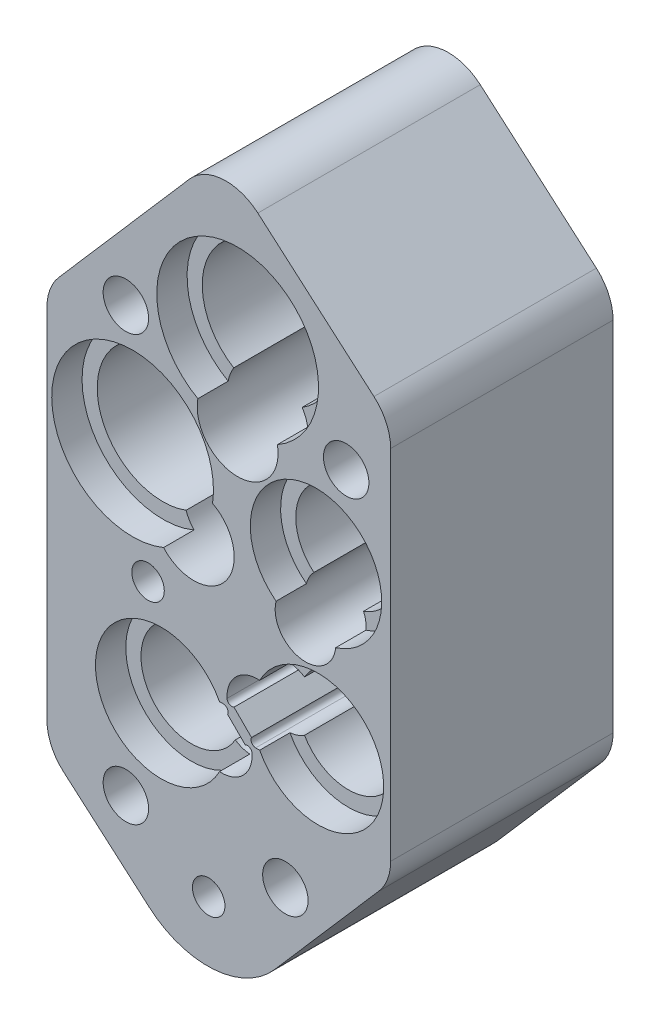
ISO-10303-21;
HEADER;
FILE_DESCRIPTION(('STEP AP214'),'2;1');
FILE_NAME('part.step','',(''),(''),'','','');
FILE_SCHEMA(('AUTOMOTIVE_DESIGN { 1 0 10303 214 1 1 1 1 }'));
ENDSEC;
DATA;
#1=APPLICATION_CONTEXT('core data for automotive mechanical design processes');
#2=APPLICATION_PROTOCOL_DEFINITION('international standard','automotive_design',2000,#1);
#3=PRODUCT_CONTEXT('',#1,'mechanical');
#4=PRODUCT('Part','Part','',(#3));
#5=PRODUCT_RELATED_PRODUCT_CATEGORY('part','',(#4));
#6=PRODUCT_DEFINITION_FORMATION('','',#4);
#7=PRODUCT_DEFINITION_CONTEXT('part definition',#1,'design');
#8=PRODUCT_DEFINITION('design','',#6,#7);
#9=PRODUCT_DEFINITION_SHAPE('','',#8);
#10=(LENGTH_UNIT() NAMED_UNIT(*) SI_UNIT(.MILLI.,.METRE.));
#11=(NAMED_UNIT(*) PLANE_ANGLE_UNIT() SI_UNIT($,.RADIAN.));
#12=(NAMED_UNIT(*) SI_UNIT($,.STERADIAN.) SOLID_ANGLE_UNIT());
#13=UNCERTAINTY_MEASURE_WITH_UNIT(LENGTH_MEASURE(1.E-05),#10,'distance_accuracy_value','');
#14=(GEOMETRIC_REPRESENTATION_CONTEXT(3) GLOBAL_UNCERTAINTY_ASSIGNED_CONTEXT((#13)) GLOBAL_UNIT_ASSIGNED_CONTEXT((#10,
#11,#12)) REPRESENTATION_CONTEXT('',''));
#15=CARTESIAN_POINT('',(0.,0.,0.));
#16=DIRECTION('',(0.,0.,1.));
#17=DIRECTION('',(1.,0.,0.));
#18=AXIS2_PLACEMENT_3D('',#15,#16,#17);
#19=CARTESIAN_POINT('',(-796.778000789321,-41.1769872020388,71.9582));
#20=DIRECTION('',(0.,0.,1.));
#21=DIRECTION('',(1.,0.,0.));
#22=AXIS2_PLACEMENT_3D('',#19,#20,#21);
#23=CYLINDRICAL_SURFACE('',#22,4.7625);
#24=DIRECTION('',(0.,0.,1.));
#25=VECTOR('',#24,1.);
#26=CARTESIAN_POINT('',(-801.532851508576,-41.4468035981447,29.5569400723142));
#27=LINE('',#26,#25);
#28=CARTESIAN_POINT('',(-801.532851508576,-41.4468035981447,37.0332));
#29=VERTEX_POINT('',#28);
#30=CARTESIAN_POINT('',(-801.532851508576,-41.4468035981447,71.9582));
#31=VERTEX_POINT('',#30);
#32=EDGE_CURVE('E369',#29,#31,#27,.T.);
#33=ORIENTED_EDGE('',*,*,#32,.F.);
#34=CARTESIAN_POINT('',(-796.778000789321,-41.1769872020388,37.0332));
#35=DIRECTION('',(0.,0.,1.));
#36=DIRECTION('',(1.,0.,0.));
#37=AXIS2_PLACEMENT_3D('',#34,#35,#36);
#38=CIRCLE('',#37,4.7625);
#39=CARTESIAN_POINT('',(-794.132167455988,-37.217066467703,37.0332));
#40=VERTEX_POINT('',#39);
#41=EDGE_CURVE('E384',#40,#29,#38,.T.);
#42=ORIENTED_EDGE('',*,*,#41,.F.);
#43=DIRECTION('',(0.,0.,1.));
#44=VECTOR('',#43,1.);
#45=CARTESIAN_POINT('',(-794.132167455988,-37.217066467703,52.11445));
#46=LINE('',#45,#44);
#47=CARTESIAN_POINT('',(-794.132167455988,-37.217066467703,67.1957));
#48=VERTEX_POINT('',#47);
#49=EDGE_CURVE('E748',#40,#48,#46,.T.);
#50=ORIENTED_EDGE('',*,*,#49,.T.);
#51=CARTESIAN_POINT('',(-796.778000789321,-41.1769872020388,67.1957));
#52=DIRECTION('',(0.,0.,-1.));
#53=DIRECTION('',(-1.,0.,0.));
#54=AXIS2_PLACEMENT_3D('',#51,#52,#53);
#55=CIRCLE('',#54,4.7625);
#56=CARTESIAN_POINT('',(-796.414198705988,-36.4284027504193,67.1957));
#57=VERTEX_POINT('',#56);
#58=EDGE_CURVE('E972',#48,#57,#55,.F.);
#59=ORIENTED_EDGE('',*,*,#58,.T.);
#60=DIRECTION('',(0.,0.,1.));
#61=VECTOR('',#60,1.);
#62=CARTESIAN_POINT('',(-796.414198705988,-36.4284027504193,69.57695));
#63=LINE('',#62,#61);
#64=CARTESIAN_POINT('',(-796.414198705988,-36.4284027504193,71.9582));
#65=VERTEX_POINT('',#64);
#66=EDGE_CURVE('E967',#57,#65,#63,.T.);
#67=ORIENTED_EDGE('',*,*,#66,.T.);
#68=CARTESIAN_POINT('',(-796.778000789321,-41.1769872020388,71.9582));
#69=DIRECTION('',(0.,0.,1.));
#70=DIRECTION('',(1.,0.,0.));
#71=AXIS2_PLACEMENT_3D('',#68,#69,#70);
#72=CIRCLE('',#71,4.7625);
#73=EDGE_CURVE('E1005',#65,#31,#72,.T.);
#74=ORIENTED_EDGE('',*,*,#73,.T.);
#75=EDGE_LOOP('',(#33,#42,#50,#59,#67,#74));
#76=FACE_BOUND('',#75,.T.);
#77=ADVANCED_FACE('F54',(#76),#23,.F.);
#78=CARTESIAN_POINT('',(-802.354782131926,-47.2412554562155,71.9582));
#79=DIRECTION('',(0.,0.,1.));
#80=DIRECTION('',(1.,0.,0.));
#81=AXIS2_PLACEMENT_3D('',#78,#79,#80);
#82=CYLINDRICAL_SURFACE('',#81,4.7625);
#83=DIRECTION('',(0.,0.,1.));
#84=VECTOR('',#83,1.);
#85=CARTESIAN_POINT('',(-797.599931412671,-46.9714390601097,29.5569400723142));
#86=LINE('',#85,#84);
#87=CARTESIAN_POINT('',(-797.599931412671,-46.9714390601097,37.0332));
#88=VERTEX_POINT('',#87);
#89=CARTESIAN_POINT('',(-797.599931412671,-46.9714390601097,71.9582));
#90=VERTEX_POINT('',#89);
#91=EDGE_CURVE('E923',#88,#90,#86,.T.);
#92=ORIENTED_EDGE('',*,*,#91,.F.);
#93=CARTESIAN_POINT('',(-802.354782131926,-47.2412554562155,37.0332));
#94=DIRECTION('',(0.,0.,1.));
#95=DIRECTION('',(1.,0.,0.));
#96=AXIS2_PLACEMENT_3D('',#93,#94,#95);
#97=CIRCLE('',#96,4.7625);
#98=CARTESIAN_POINT('',(-805.000615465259,-51.2011761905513,37.0332));
#99=VERTEX_POINT('',#98);
#100=EDGE_CURVE('E646',#99,#88,#97,.T.);
#101=ORIENTED_EDGE('',*,*,#100,.F.);
#102=DIRECTION('',(0.,0.,1.));
#103=VECTOR('',#102,1.);
#104=CARTESIAN_POINT('',(-805.000615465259,-51.2011761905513,52.11445));
#105=LINE('',#104,#103);
#106=CARTESIAN_POINT('',(-805.000615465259,-51.2011761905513,67.1957));
#107=VERTEX_POINT('',#106);
#108=EDGE_CURVE('E990',#99,#107,#105,.T.);
#109=ORIENTED_EDGE('',*,*,#108,.T.);
#110=CARTESIAN_POINT('',(-802.354782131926,-47.2412554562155,67.1957));
#111=DIRECTION('',(0.,0.,-1.));
#112=DIRECTION('',(-1.,0.,0.));
#113=AXIS2_PLACEMENT_3D('',#110,#111,#112);
#114=CIRCLE('',#113,4.7625);
#115=CARTESIAN_POINT('',(-802.718584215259,-51.989839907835,67.1957));
#116=VERTEX_POINT('',#115);
#117=EDGE_CURVE('E989',#107,#116,#114,.F.);
#118=ORIENTED_EDGE('',*,*,#117,.T.);
#119=DIRECTION('',(0.,0.,1.));
#120=VECTOR('',#119,1.);
#121=CARTESIAN_POINT('',(-802.718584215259,-51.989839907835,69.57695));
#122=LINE('',#121,#120);
#123=CARTESIAN_POINT('',(-802.718584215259,-51.989839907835,71.9582));
#124=VERTEX_POINT('',#123);
#125=EDGE_CURVE('E984',#116,#124,#122,.T.);
#126=ORIENTED_EDGE('',*,*,#125,.T.);
#127=CARTESIAN_POINT('',(-802.354782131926,-47.2412554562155,71.9582));
#128=DIRECTION('',(0.,0.,1.));
#129=DIRECTION('',(1.,0.,0.));
#130=AXIS2_PLACEMENT_3D('',#127,#128,#129);
#131=CIRCLE('',#130,4.7625);
#132=EDGE_CURVE('E385',#124,#90,#131,.T.);
#133=ORIENTED_EDGE('',*,*,#132,.T.);
#134=EDGE_LOOP('',(#92,#101,#109,#118,#126,#133));
#135=FACE_BOUND('',#134,.T.);
#136=ADVANCED_FACE('F1094',(#135),#82,.F.);
#137=CARTESIAN_POINT('',(-804.597058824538,-65.405,71.9582));
#138=DIRECTION('',(0.,0.,-1.));
#139=DIRECTION('',(-1.,0.,0.));
#140=AXIS2_PLACEMENT_3D('',#137,#138,#139);
#141=PLANE('',#140);
#142=CARTESIAN_POINT('',(-804.418,-69.846392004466,71.9582));
#143=DIRECTION('',(0.,0.,1.));
#144=DIRECTION('',(1.,0.,0.));
#145=AXIS2_PLACEMENT_3D('',#142,#143,#144);
#146=CIRCLE('',#145,2.55269999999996);
#147=CARTESIAN_POINT('',(-801.8653,-69.846392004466,71.9582));
#148=VERTEX_POINT('',#147);
#149=EDGE_CURVE('E553',#148,#148,#146,.T.);
#150=ORIENTED_EDGE('',*,*,#149,.F.);
#151=EDGE_LOOP('',(#150));
#152=FACE_BOUND('',#151,.T.);
#153=CARTESIAN_POINT('',(-813.943,-31.7499999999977,71.9582));
#154=DIRECTION('',(0.,0.,1.));
#155=DIRECTION('',(1.,0.,0.));
#156=AXIS2_PLACEMENT_3D('',#153,#154,#155);
#157=CIRCLE('',#156,2.55269999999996);
#158=CARTESIAN_POINT('',(-811.3903,-31.7499999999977,71.9582));
#159=VERTEX_POINT('',#158);
#160=EDGE_CURVE('E542',#159,#159,#157,.T.);
#161=ORIENTED_EDGE('',*,*,#160,.F.);
#162=EDGE_LOOP('',(#161));
#163=FACE_BOUND('',#162,.T.);
#164=CARTESIAN_POINT('',(-797.047817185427,-45.931837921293,71.9582));
#165=VERTEX_POINT('',#164);
#166=CARTESIAN_POINT('',(-796.414198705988,-45.9255716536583,71.9582));
#167=VERTEX_POINT('',#166);
#168=EDGE_CURVE('E1001',#165,#167,#72,.T.);
#169=ORIENTED_EDGE('',*,*,#168,.F.);
#170=CARTESIAN_POINT('',(-797.00464656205,-45.1710618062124,71.9582));
#171=DIRECTION('',(0.,0.,-1.));
#172=DIRECTION('',(1.,0.,0.));
#173=AXIS2_PLACEMENT_3D('',#170,#171,#172);
#174=CIRCLE('',#173,0.761999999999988);
#175=CARTESIAN_POINT('',(-797.692251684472,-44.8426669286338,71.9582));
#176=VERTEX_POINT('',#175);
#177=EDGE_CURVE('E72',#165,#176,#174,.T.);
#178=ORIENTED_EDGE('',*,*,#177,.T.);
#179=DIRECTION('',(-0.707106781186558,0.707106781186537,0.));
#180=VECTOR('',#179,1.);
#181=CARTESIAN_POINT('',(-800.443680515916,-42.0912380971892,71.9582));
#182=LINE('',#181,#180);
#183=CARTESIAN_POINT('',(-800.443680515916,-42.0912380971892,71.9582));
#184=VERTEX_POINT('',#183);
#185=EDGE_CURVE('E343',#176,#184,#182,.T.);
#186=ORIENTED_EDGE('',*,*,#185,.T.);
#187=CARTESIAN_POINT('',(-800.772075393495,-41.4036329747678,71.9582));
#188=DIRECTION('',(0.,0.,-1.));
#189=DIRECTION('',(1.,0.,0.));
#190=AXIS2_PLACEMENT_3D('',#187,#188,#189);
#191=CIRCLE('',#190,0.76200000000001);
#192=EDGE_CURVE('E338',#184,#31,#191,.T.);
#193=ORIENTED_EDGE('',*,*,#192,.T.);
#194=ORIENTED_EDGE('',*,*,#73,.F.);
#195=CARTESIAN_POINT('',(-787.253000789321,-41.1769872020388,71.9582));
#196=DIRECTION('',(0.,0.,1.));
#197=DIRECTION('',(1.,0.,0.));
#198=AXIS2_PLACEMENT_3D('',#195,#196,#197);
#199=CIRCLE('',#198,10.31875);
#200=EDGE_CURVE('E702',#167,#65,#199,.T.);
#201=ORIENTED_EDGE('',*,*,#200,.F.);
#202=EDGE_LOOP('',(#169,#178,#186,#193,#194,#201));
#203=FACE_BOUND('',#202,.T.);
#204=CARTESIAN_POINT('',(-782.828,-1.00168590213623,71.9582));
#205=DIRECTION('',(0.,0.,-1.));
#206=DIRECTION('',(-1.,0.,0.));
#207=AXIS2_PLACEMENT_3D('',#204,#205,#206);
#208=CIRCLE('',#207,3.56869999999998);
#209=CARTESIAN_POINT('',(-786.3967,-1.00168590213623,71.9582));
#210=VERTEX_POINT('',#209);
#211=EDGE_CURVE('E368',#210,#210,#208,.T.);
#212=ORIENTED_EDGE('',*,*,#211,.T.);
#213=EDGE_LOOP('',(#212));
#214=FACE_BOUND('',#213,.T.);
#215=CARTESIAN_POINT('',(-817.424993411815,4.0783140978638,71.9582));
#216=DIRECTION('',(0.,0.,-1.));
#217=DIRECTION('',(-1.,0.,0.));
#218=AXIS2_PLACEMENT_3D('',#215,#216,#217);
#219=CIRCLE('',#218,3.56869999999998);
#220=CARTESIAN_POINT('',(-820.993693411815,4.0783140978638,71.9582));
#221=VERTEX_POINT('',#220);
#222=EDGE_CURVE('E519',#221,#221,#219,.T.);
#223=ORIENTED_EDGE('',*,*,#222,.T.);
#224=EDGE_LOOP('',(#223));
#225=FACE_BOUND('',#224,.T.);
#226=CARTESIAN_POINT('',(-792.378161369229,-62.5966859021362,71.9582));
#227=DIRECTION('',(0.,0.,-1.));
#228=DIRECTION('',(-1.,0.,0.));
#229=AXIS2_PLACEMENT_3D('',#226,#227,#228);
#230=CIRCLE('',#229,3.56869999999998);
#231=CARTESIAN_POINT('',(-795.946861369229,-62.5966859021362,71.9582));
#232=VERTEX_POINT('',#231);
#233=EDGE_CURVE('E496',#232,#232,#230,.T.);
#234=ORIENTED_EDGE('',*,*,#233,.T.);
#235=EDGE_LOOP('',(#234));
#236=FACE_BOUND('',#235,.T.);
#237=CARTESIAN_POINT('',(-817.424993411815,-62.5966859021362,71.9582));
#238=DIRECTION('',(0.,0.,-1.));
#239=DIRECTION('',(-1.,0.,0.));
#240=AXIS2_PLACEMENT_3D('',#237,#238,#239);
#241=CIRCLE('',#240,3.56869999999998);
#242=CARTESIAN_POINT('',(-820.993693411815,-62.5966859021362,71.9582));
#243=VERTEX_POINT('',#242);
#244=EDGE_CURVE('E454',#243,#243,#241,.T.);
#245=ORIENTED_EDGE('',*,*,#244,.T.);
#246=EDGE_LOOP('',(#245));
#247=FACE_BOUND('',#246,.T.);
#248=CARTESIAN_POINT('',(-816.367816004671,-14.1799178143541,71.9582));
#249=DIRECTION('',(0.,0.,1.));
#250=DIRECTION('',(1.,0.,0.));
#251=AXIS2_PLACEMENT_3D('',#248,#249,#250);
#252=CIRCLE('',#251,12.7);
#253=CARTESIAN_POINT('',(-803.808343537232,-16.0639696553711,71.9582));
#254=VERTEX_POINT('',#253);
#255=CARTESIAN_POINT('',(-811.501317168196,-25.9105268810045,71.9582));
#256=VERTEX_POINT('',#255);
#257=EDGE_CURVE('E728',#254,#256,#252,.T.);
#258=ORIENTED_EDGE('',*,*,#257,.F.);
#259=CARTESIAN_POINT('',(-806.760388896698,-21.6860625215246,71.9582));
#260=DIRECTION('',(0.,0.,1.));
#261=DIRECTION('',(1.,0.,0.));
#262=AXIS2_PLACEMENT_3D('',#259,#260,#261);
#263=CIRCLE('',#262,6.34999999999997);
#264=EDGE_CURVE('E785',#256,#254,#263,.T.);
#265=ORIENTED_EDGE('',*,*,#264,.F.);
#266=EDGE_LOOP('',(#258,#265));
#267=FACE_BOUND('',#266,.T.);
#268=CARTESIAN_POINT('',(-804.597058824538,-65.405,71.9582));
#269=DIRECTION('',(0.,0.,-1.));
#270=DIRECTION('',(-1.,0.,0.));
#271=AXIS2_PLACEMENT_3D('',#268,#269,#270);
#272=CIRCLE('',#271,13.9699999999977);
#273=CARTESIAN_POINT('',(-794.049288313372,-74.5649911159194,71.9582));
#274=VERTEX_POINT('',#273);
#275=CARTESIAN_POINT('',(-813.757049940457,-75.9527705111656,71.9582));
#276=VERTEX_POINT('',#275);
#277=EDGE_CURVE('E1004',#274,#276,#272,.T.);
#278=ORIENTED_EDGE('',*,*,#277,.F.);
#279=DIRECTION('',(-0.655690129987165,-0.755030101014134,0.));
#280=VECTOR('',#279,1.);
#281=CARTESIAN_POINT('',(-777.709670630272,-55.7498486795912,71.9582));
#282=LINE('',#281,#280);
#283=CARTESIAN_POINT('',(-777.709670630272,-55.7498486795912,71.9582));
#284=VERTEX_POINT('',#283);
#285=EDGE_CURVE('E436',#284,#274,#282,.T.);
#286=ORIENTED_EDGE('',*,*,#285,.F.);
#287=CARTESIAN_POINT('',(-783.463,-50.7534898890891,71.9582));
#288=DIRECTION('',(0.,0.,-1.));
#289=DIRECTION('',(-1.,0.,0.));
#290=AXIS2_PLACEMENT_3D('',#287,#288,#289);
#291=CIRCLE('',#290,7.61999999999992);
#292=CARTESIAN_POINT('',(-775.843,-50.7534898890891,71.9582));
#293=VERTEX_POINT('',#292);
#294=EDGE_CURVE('E430',#293,#284,#291,.T.);
#295=ORIENTED_EDGE('',*,*,#294,.F.);
#296=DIRECTION('',(0.,-1.,0.));
#297=VECTOR('',#296,1.);
#298=CARTESIAN_POINT('',(-775.843,5.39033140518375,71.9582));
#299=LINE('',#298,#297);
#300=CARTESIAN_POINT('',(-775.843,5.39033140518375,71.9582));
#301=VERTEX_POINT('',#300);
#302=EDGE_CURVE('E437',#301,#293,#299,.T.);
#303=ORIENTED_EDGE('',*,*,#302,.F.);
#304=CARTESIAN_POINT('',(-783.463,5.39033140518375,71.9582));
#305=DIRECTION('',(0.,0.,-1.));
#306=DIRECTION('',(1.,0.,0.));
#307=AXIS2_PLACEMENT_3D('',#304,#305,#306);
#308=CIRCLE('',#307,7.61999999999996);
#309=CARTESIAN_POINT('',(-778.466641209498,11.1436607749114,71.9582));
#310=VERTEX_POINT('',#309);
#311=EDGE_CURVE('E1576',#310,#301,#308,.T.);
#312=ORIENTED_EDGE('',*,*,#311,.F.);
#313=DIRECTION('',(0.755030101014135,-0.655690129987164,0.));
#314=VECTOR('',#313,1.);
#315=CARTESIAN_POINT('',(-778.466641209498,11.1436607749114,71.9582));
#316=LINE('',#315,#314);
#317=CARTESIAN_POINT('',(-796.698391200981,26.9766434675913,71.9582));
#318=VERTEX_POINT('',#317);
#319=EDGE_CURVE('E1584',#318,#310,#316,.T.);
#320=ORIENTED_EDGE('',*,*,#319,.F.);
#321=CARTESIAN_POINT('',(-801.694749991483,21.2233140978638,71.9582));
#322=DIRECTION('',(0.,0.,-1.));
#323=DIRECTION('',(1.,0.,0.));
#324=AXIS2_PLACEMENT_3D('',#321,#322,#323);
#325=CIRCLE('',#324,7.61999999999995);
#326=CARTESIAN_POINT('',(-807.448079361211,26.2196728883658,71.9582));
#327=VERTEX_POINT('',#326);
#328=EDGE_CURVE('E1564',#327,#318,#325,.T.);
#329=ORIENTED_EDGE('',*,*,#328,.F.);
#330=DIRECTION('',(0.655690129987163,0.755030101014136,0.));
#331=VECTOR('',#330,1.);
#332=CARTESIAN_POINT('',(-807.448079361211,26.2196728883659,71.9582));
#333=LINE('',#332,#331);
#334=CARTESIAN_POINT('',(-827.951329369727,2.61008931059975,71.9582));
#335=VERTEX_POINT('',#334);
#336=EDGE_CURVE('E584',#335,#327,#333,.T.);
#337=ORIENTED_EDGE('',*,*,#336,.F.);
#338=CARTESIAN_POINT('',(-822.198,-2.38626947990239,71.9582));
#339=DIRECTION('',(0.,0.,-1.));
#340=DIRECTION('',(-1.,0.,0.));
#341=AXIS2_PLACEMENT_3D('',#338,#339,#340);
#342=CIRCLE('',#341,7.61999999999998);
#343=CARTESIAN_POINT('',(-829.818,-2.38626947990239,71.9582));
#344=VERTEX_POINT('',#343);
#345=EDGE_CURVE('E577',#344,#335,#342,.T.);
#346=ORIENTED_EDGE('',*,*,#345,.F.);
#347=DIRECTION('',(0.,1.,0.));
#348=VECTOR('',#347,1.);
#349=CARTESIAN_POINT('',(-829.818,-2.38626947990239,71.9582));
#350=LINE('',#349,#348);
#351=CARTESIAN_POINT('',(-829.818,-58.5300907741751,71.9582));
#352=VERTEX_POINT('',#351);
#353=EDGE_CURVE('E571',#352,#344,#350,.T.);
#354=ORIENTED_EDGE('',*,*,#353,.F.);
#355=CARTESIAN_POINT('',(-822.198,-58.5300907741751,71.9582));
#356=DIRECTION('',(0.,0.,-1.));
#357=DIRECTION('',(-1.,0.,0.));
#358=AXIS2_PLACEMENT_3D('',#355,#356,#357);
#359=CIRCLE('',#358,7.61999999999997);
#360=CARTESIAN_POINT('',(-827.194358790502,-64.2834201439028,71.9582));
#361=VERTEX_POINT('',#360);
#362=EDGE_CURVE('E578',#361,#352,#359,.T.);
#363=ORIENTED_EDGE('',*,*,#362,.F.);
#364=DIRECTION('',(-0.755030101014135,0.655690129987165,0.));
#365=VECTOR('',#364,1.);
#366=CARTESIAN_POINT('',(-813.757049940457,-75.9527705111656,71.9582));
#367=LINE('',#366,#365);
#368=EDGE_CURVE('E1012',#276,#361,#367,.T.);
#369=ORIENTED_EDGE('',*,*,#368,.F.);
#370=EDGE_LOOP('',(#278,#286,#295,#303,#312,#320,#329,#337,#346,#354,#363,#369));
#371=FACE_BOUND('',#370,.T.);
#372=CARTESIAN_POINT('',(-789.220778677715,-25.5532134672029,71.9582));
#373=DIRECTION('',(0.,0.,1.));
#374=DIRECTION('',(1.,0.,0.));
#375=AXIS2_PLACEMENT_3D('',#372,#373,#374);
#376=CIRCLE('',#375,4.7625);
#377=CARTESIAN_POINT('',(-793.834047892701,-24.3703553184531,71.9582));
#378=VERTEX_POINT('',#377);
#379=CARTESIAN_POINT('',(-784.481162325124,-26.0195213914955,71.9582));
#380=VERTEX_POINT('',#379);
#381=EDGE_CURVE('E642',#378,#380,#376,.T.);
#382=ORIENTED_EDGE('',*,*,#381,.F.);
#383=CARTESIAN_POINT('',(-787.566779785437,-16.1729196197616,71.9582));
#384=DIRECTION('',(0.,0.,1.));
#385=DIRECTION('',(1.,0.,0.));
#386=AXIS2_PLACEMENT_3D('',#383,#384,#385);
#387=CIRCLE('',#386,10.31875);
#388=EDGE_CURVE('E659',#380,#378,#387,.T.);
#389=ORIENTED_EDGE('',*,*,#388,.F.);
#390=EDGE_LOOP('',(#382,#389));
#391=FACE_BOUND('',#390,.T.);
#392=CARTESIAN_POINT('',(-798.360707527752,-47.0146096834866,71.9582));
#393=DIRECTION('',(0.,0.,-1.));
#394=DIRECTION('',(1.,0.,0.));
#395=AXIS2_PLACEMENT_3D('',#392,#393,#394);
#396=CIRCLE('',#395,0.762000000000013);
#397=CARTESIAN_POINT('',(-798.689102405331,-46.3270045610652,71.9582));
#398=VERTEX_POINT('',#397);
#399=EDGE_CURVE('E936',#398,#90,#396,.T.);
#400=ORIENTED_EDGE('',*,*,#399,.T.);
#401=ORIENTED_EDGE('',*,*,#132,.F.);
#402=CARTESIAN_POINT('',(-811.879782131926,-47.2412554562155,71.9582));
#403=DIRECTION('',(0.,0.,1.));
#404=DIRECTION('',(1.,0.,0.));
#405=AXIS2_PLACEMENT_3D('',#402,#403,#404);
#406=CIRCLE('',#405,10.31875);
#407=CARTESIAN_POINT('',(-802.718584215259,-42.492671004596,71.9582));
#408=VERTEX_POINT('',#407);
#409=EDGE_CURVE('E688',#408,#124,#406,.T.);
#410=ORIENTED_EDGE('',*,*,#409,.F.);
#411=CARTESIAN_POINT('',(-802.084965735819,-42.4864047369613,71.9582));
#412=VERTEX_POINT('',#411);
#413=EDGE_CURVE('E380',#412,#408,#131,.T.);
#414=ORIENTED_EDGE('',*,*,#413,.F.);
#415=CARTESIAN_POINT('',(-802.128136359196,-43.247180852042,71.9582));
#416=DIRECTION('',(0.,0.,-1.));
#417=DIRECTION('',(1.,0.,0.));
#418=AXIS2_PLACEMENT_3D('',#415,#416,#417);
#419=CIRCLE('',#418,0.762000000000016);
#420=CARTESIAN_POINT('',(-801.440531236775,-43.5755757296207,71.9582));
#421=VERTEX_POINT('',#420);
#422=EDGE_CURVE('E80',#412,#421,#419,.T.);
#423=ORIENTED_EDGE('',*,*,#422,.T.);
#424=DIRECTION('',(0.707106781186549,-0.707106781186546,0.));
#425=VECTOR('',#424,1.);
#426=CARTESIAN_POINT('',(-798.689102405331,-46.3270045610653,71.9582));
#427=LINE('',#426,#425);
#428=EDGE_CURVE('E331',#421,#398,#427,.T.);
#429=ORIENTED_EDGE('',*,*,#428,.T.);
#430=EDGE_LOOP('',(#400,#401,#410,#414,#423,#429));
#431=FACE_BOUND('',#430,.T.);
#432=CARTESIAN_POINT('',(-799.873146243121,8.08228682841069,71.9582));
#433=DIRECTION('',(0.,0.,1.));
#434=DIRECTION('',(1.,0.,0.));
#435=AXIS2_PLACEMENT_3D('',#432,#433,#434);
#436=CIRCLE('',#435,12.7);
#437=CARTESIAN_POINT('',(-793.62541600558,-2.97465067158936,71.9582));
#438=VERTEX_POINT('',#437);
#439=CARTESIAN_POINT('',(-806.120876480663,-2.97465067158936,71.9582));
#440=VERTEX_POINT('',#439);
#441=EDGE_CURVE('E12',#438,#440,#436,.T.);
#442=ORIENTED_EDGE('',*,*,#441,.F.);
#443=CARTESIAN_POINT('',(-799.873146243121,-4.10971317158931,71.9582));
#444=DIRECTION('',(0.,0.,1.));
#445=DIRECTION('',(1.,0.,0.));
#446=AXIS2_PLACEMENT_3D('',#443,#444,#445);
#447=CIRCLE('',#446,6.34999999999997);
#448=EDGE_CURVE('E663',#440,#438,#447,.T.);
#449=ORIENTED_EDGE('',*,*,#448,.F.);
#450=EDGE_LOOP('',(#442,#449));
#451=FACE_BOUND('',#450,.T.);
#452=ADVANCED_FACE('F944',(#152,#163,#203,#214,#225,#236,#247,#267,#371,#391,#431,#451),#141,.F.);
#453=CARTESIAN_POINT('',(-804.597058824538,-65.405,37.0332));
#454=DIRECTION('',(0.,0.,-1.));
#455=DIRECTION('',(-1.,0.,0.));
#456=AXIS2_PLACEMENT_3D('',#453,#454,#455);
#457=PLANE('',#456);
#458=CARTESIAN_POINT('',(-804.418,-69.846392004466,37.0332));
#459=DIRECTION('',(0.,0.,1.));
#460=DIRECTION('',(1.,0.,0.));
#461=AXIS2_PLACEMENT_3D('',#458,#459,#460);
#462=CIRCLE('',#461,2.55269999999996);
#463=CARTESIAN_POINT('',(-801.8653,-69.846392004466,37.0332));
#464=VERTEX_POINT('',#463);
#465=EDGE_CURVE('E558',#464,#464,#462,.T.);
#466=ORIENTED_EDGE('',*,*,#465,.T.);
#467=EDGE_LOOP('',(#466));
#468=FACE_BOUND('',#467,.T.);
#469=CARTESIAN_POINT('',(-813.943,-31.7499999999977,37.0332));
#470=DIRECTION('',(0.,0.,1.));
#471=DIRECTION('',(1.,0.,0.));
#472=AXIS2_PLACEMENT_3D('',#469,#470,#471);
#473=CIRCLE('',#472,2.55269999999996);
#474=CARTESIAN_POINT('',(-811.3903,-31.7499999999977,37.0332));
#475=VERTEX_POINT('',#474);
#476=EDGE_CURVE('E547',#475,#475,#473,.T.);
#477=ORIENTED_EDGE('',*,*,#476,.T.);
#478=EDGE_LOOP('',(#477));
#479=FACE_BOUND('',#478,.T.);
#480=CARTESIAN_POINT('',(-797.00464656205,-45.1710618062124,37.0332));
#481=DIRECTION('',(0.,0.,-1.));
#482=DIRECTION('',(-1.,0.,0.));
#483=AXIS2_PLACEMENT_3D('',#480,#481,#482);
#484=CIRCLE('',#483,0.761999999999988);
#485=CARTESIAN_POINT('',(-797.047817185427,-45.9318379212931,37.0332));
#486=VERTEX_POINT('',#485);
#487=CARTESIAN_POINT('',(-797.692251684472,-44.8426669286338,37.0332));
#488=VERTEX_POINT('',#487);
#489=EDGE_CURVE('E914',#486,#488,#484,.T.);
#490=ORIENTED_EDGE('',*,*,#489,.F.);
#491=CARTESIAN_POINT('',(-794.132167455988,-45.1369079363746,37.0332));
#492=VERTEX_POINT('',#491);
#493=EDGE_CURVE('E389',#486,#492,#38,.T.);
#494=ORIENTED_EDGE('',*,*,#493,.T.);
#495=CARTESIAN_POINT('',(-787.253000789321,-41.1769872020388,37.0332));
#496=DIRECTION('',(0.,0.,-1.));
#497=DIRECTION('',(-1.,0.,0.));
#498=AXIS2_PLACEMENT_3D('',#495,#496,#497);
#499=CIRCLE('',#498,7.93750000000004);
#500=EDGE_CURVE('E741',#40,#492,#499,.T.);
#501=ORIENTED_EDGE('',*,*,#500,.F.);
#502=ORIENTED_EDGE('',*,*,#41,.T.);
#503=CARTESIAN_POINT('',(-800.772075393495,-41.4036329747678,37.0332));
#504=DIRECTION('',(0.,0.,-1.));
#505=DIRECTION('',(-1.,0.,0.));
#506=AXIS2_PLACEMENT_3D('',#503,#504,#505);
#507=CIRCLE('',#506,0.76200000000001);
#508=CARTESIAN_POINT('',(-800.443680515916,-42.0912380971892,37.0332));
#509=VERTEX_POINT('',#508);
#510=EDGE_CURVE('E350',#509,#29,#507,.T.);
#511=ORIENTED_EDGE('',*,*,#510,.F.);
#512=DIRECTION('',(-0.707106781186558,0.707106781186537,0.));
#513=VECTOR('',#512,1.);
#514=CARTESIAN_POINT('',(-800.443680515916,-42.0912380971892,37.0332));
#515=LINE('',#514,#513);
#516=EDGE_CURVE('E906',#488,#509,#515,.T.);
#517=ORIENTED_EDGE('',*,*,#516,.F.);
#518=EDGE_LOOP('',(#490,#494,#501,#502,#511,#517));
#519=FACE_BOUND('',#518,.T.);
#520=CARTESIAN_POINT('',(-782.828,-1.00168590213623,37.0332));
#521=DIRECTION('',(0.,0.,-1.));
#522=DIRECTION('',(-1.,0.,0.));
#523=AXIS2_PLACEMENT_3D('',#520,#521,#522);
#524=CIRCLE('',#523,5.35940000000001);
#525=CARTESIAN_POINT('',(-788.1874,-1.00168590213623,37.0332));
#526=VERTEX_POINT('',#525);
#527=EDGE_CURVE('E530',#526,#526,#524,.T.);
#528=ORIENTED_EDGE('',*,*,#527,.F.);
#529=EDGE_LOOP('',(#528));
#530=FACE_BOUND('',#529,.T.);
#531=CARTESIAN_POINT('',(-817.424993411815,4.0783140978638,37.0332));
#532=DIRECTION('',(0.,0.,-1.));
#533=DIRECTION('',(-1.,0.,0.));
#534=AXIS2_PLACEMENT_3D('',#531,#532,#533);
#535=CIRCLE('',#534,5.35940000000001);
#536=CARTESIAN_POINT('',(-822.784393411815,4.0783140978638,37.0332));
#537=VERTEX_POINT('',#536);
#538=EDGE_CURVE('E501',#537,#537,#535,.T.);
#539=ORIENTED_EDGE('',*,*,#538,.F.);
#540=EDGE_LOOP('',(#539));
#541=FACE_BOUND('',#540,.T.);
#542=CARTESIAN_POINT('',(-792.378161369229,-62.5966859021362,37.0332));
#543=DIRECTION('',(0.,0.,-1.));
#544=DIRECTION('',(-1.,0.,0.));
#545=AXIS2_PLACEMENT_3D('',#542,#543,#544);
#546=CIRCLE('',#545,5.35940000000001);
#547=CARTESIAN_POINT('',(-797.737561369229,-62.5966859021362,37.0332));
#548=VERTEX_POINT('',#547);
#549=EDGE_CURVE('E461',#548,#548,#546,.T.);
#550=ORIENTED_EDGE('',*,*,#549,.F.);
#551=EDGE_LOOP('',(#550));
#552=FACE_BOUND('',#551,.T.);
#553=CARTESIAN_POINT('',(-817.424993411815,-62.5966859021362,37.0332));
#554=DIRECTION('',(0.,0.,-1.));
#555=DIRECTION('',(-1.,0.,0.));
#556=AXIS2_PLACEMENT_3D('',#553,#554,#555);
#557=CIRCLE('',#556,5.35940000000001);
#558=CARTESIAN_POINT('',(-822.784393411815,-62.5966859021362,37.0332));
#559=VERTEX_POINT('',#558);
#560=EDGE_CURVE('E858',#559,#559,#557,.T.);
#561=ORIENTED_EDGE('',*,*,#560,.F.);
#562=EDGE_LOOP('',(#561));
#563=FACE_BOUND('',#562,.T.);
#564=CARTESIAN_POINT('',(-799.873146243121,8.08228682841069,37.0332));
#565=DIRECTION('',(0.,0.,1.));
#566=DIRECTION('',(1.,0.,0.));
#567=AXIS2_PLACEMENT_3D('',#564,#565,#566);
#568=CIRCLE('',#567,10.31875);
#569=CARTESIAN_POINT('',(-794.499330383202,-0.726725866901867,37.0332));
#570=VERTEX_POINT('',#569);
#571=CARTESIAN_POINT('',(-805.246962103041,-0.726725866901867,37.0332));
#572=VERTEX_POINT('',#571);
#573=EDGE_CURVE('E853',#570,#572,#568,.T.);
#574=ORIENTED_EDGE('',*,*,#573,.T.);
#575=CARTESIAN_POINT('',(-799.873146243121,-4.10971317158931,37.0332));
#576=DIRECTION('',(0.,0.,1.));
#577=DIRECTION('',(1.,0.,0.));
#578=AXIS2_PLACEMENT_3D('',#575,#576,#577);
#579=CIRCLE('',#578,6.34999999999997);
#580=EDGE_CURVE('E777',#572,#570,#579,.T.);
#581=ORIENTED_EDGE('',*,*,#580,.T.);
#582=EDGE_LOOP('',(#574,#581));
#583=FACE_BOUND('',#582,.T.);
#584=CARTESIAN_POINT('',(-816.367816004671,-14.1799178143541,37.0332));
#585=DIRECTION('',(0.,0.,1.));
#586=DIRECTION('',(1.,0.,0.));
#587=AXIS2_PLACEMENT_3D('',#584,#585,#586);
#588=CIRCLE('',#587,10.31875);
#589=CARTESIAN_POINT('',(-806.11776787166,-15.3686628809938,37.0332));
#590=VERTEX_POINT('',#589);
#591=CARTESIAN_POINT('',(-812.734670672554,-23.8379122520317,37.0332));
#592=VERTEX_POINT('',#591);
#593=EDGE_CURVE('E840',#590,#592,#588,.T.);
#594=ORIENTED_EDGE('',*,*,#593,.T.);
#595=CARTESIAN_POINT('',(-806.760388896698,-21.6860625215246,37.0332));
#596=DIRECTION('',(0.,0.,1.));
#597=DIRECTION('',(1.,0.,0.));
#598=AXIS2_PLACEMENT_3D('',#595,#596,#597);
#599=CIRCLE('',#598,6.34999999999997);
#600=EDGE_CURVE('E781',#592,#590,#599,.T.);
#601=ORIENTED_EDGE('',*,*,#600,.T.);
#602=EDGE_LOOP('',(#594,#601));
#603=FACE_BOUND('',#602,.T.);
#604=ORIENTED_EDGE('',*,*,#100,.T.);
#605=CARTESIAN_POINT('',(-798.360707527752,-47.0146096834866,37.0332));
#606=DIRECTION('',(0.,0.,-1.));
#607=DIRECTION('',(-1.,0.,0.));
#608=AXIS2_PLACEMENT_3D('',#605,#606,#607);
#609=CIRCLE('',#608,0.762000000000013);
#610=CARTESIAN_POINT('',(-798.689102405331,-46.3270045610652,37.0332));
#611=VERTEX_POINT('',#610);
#612=EDGE_CURVE('E321',#611,#88,#609,.T.);
#613=ORIENTED_EDGE('',*,*,#612,.F.);
#614=DIRECTION('',(0.707106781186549,-0.707106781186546,0.));
#615=VECTOR('',#614,1.);
#616=CARTESIAN_POINT('',(-798.689102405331,-46.3270045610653,37.0332));
#617=LINE('',#616,#615);
#618=CARTESIAN_POINT('',(-801.440531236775,-43.5755757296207,37.0332));
#619=VERTEX_POINT('',#618);
#620=EDGE_CURVE('E314',#619,#611,#617,.T.);
#621=ORIENTED_EDGE('',*,*,#620,.F.);
#622=CARTESIAN_POINT('',(-802.128136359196,-43.247180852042,37.0332));
#623=DIRECTION('',(0.,0.,-1.));
#624=DIRECTION('',(-1.,0.,0.));
#625=AXIS2_PLACEMENT_3D('',#622,#623,#624);
#626=CIRCLE('',#625,0.762000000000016);
#627=CARTESIAN_POINT('',(-802.084965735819,-42.4864047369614,37.0332));
#628=VERTEX_POINT('',#627);
#629=EDGE_CURVE('E320',#628,#619,#626,.T.);
#630=ORIENTED_EDGE('',*,*,#629,.F.);
#631=CARTESIAN_POINT('',(-805.000615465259,-43.2813347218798,37.0332));
#632=VERTEX_POINT('',#631);
#633=EDGE_CURVE('E386',#628,#632,#97,.T.);
#634=ORIENTED_EDGE('',*,*,#633,.T.);
#635=CARTESIAN_POINT('',(-811.879782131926,-47.2412554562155,37.0332));
#636=DIRECTION('',(0.,0.,1.));
#637=DIRECTION('',(1.,0.,0.));
#638=AXIS2_PLACEMENT_3D('',#635,#636,#637);
#639=CIRCLE('',#638,7.93750000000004);
#640=EDGE_CURVE('E706',#632,#99,#639,.T.);
#641=ORIENTED_EDGE('',*,*,#640,.T.);
#642=EDGE_LOOP('',(#604,#613,#621,#630,#634,#641));
#643=FACE_BOUND('',#642,.T.);
#644=CARTESIAN_POINT('',(-804.597058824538,-65.405,37.0332));
#645=DIRECTION('',(0.,0.,-1.));
#646=DIRECTION('',(-1.,0.,0.));
#647=AXIS2_PLACEMENT_3D('',#644,#645,#646);
#648=CIRCLE('',#647,13.9699999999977);
#649=CARTESIAN_POINT('',(-794.049288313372,-74.5649911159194,37.0332));
#650=VERTEX_POINT('',#649);
#651=CARTESIAN_POINT('',(-813.757049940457,-75.9527705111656,37.0332));
#652=VERTEX_POINT('',#651);
#653=EDGE_CURVE('E443',#650,#652,#648,.T.);
#654=ORIENTED_EDGE('',*,*,#653,.T.);
#655=DIRECTION('',(-0.755030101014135,0.655690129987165,0.));
#656=VECTOR('',#655,1.);
#657=CARTESIAN_POINT('',(-813.757049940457,-75.9527705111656,37.0332));
#658=LINE('',#657,#656);
#659=CARTESIAN_POINT('',(-827.194358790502,-64.2834201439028,37.0332));
#660=VERTEX_POINT('',#659);
#661=EDGE_CURVE('E1049',#652,#660,#658,.T.);
#662=ORIENTED_EDGE('',*,*,#661,.T.);
#663=CARTESIAN_POINT('',(-822.198,-58.5300907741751,37.0332));
#664=DIRECTION('',(0.,0.,-1.));
#665=DIRECTION('',(-1.,0.,0.));
#666=AXIS2_PLACEMENT_3D('',#663,#664,#665);
#667=CIRCLE('',#666,7.61999999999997);
#668=CARTESIAN_POINT('',(-829.818,-58.5300907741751,37.0332));
#669=VERTEX_POINT('',#668);
#670=EDGE_CURVE('E1042',#660,#669,#667,.T.);
#671=ORIENTED_EDGE('',*,*,#670,.T.);
#672=DIRECTION('',(0.,1.,0.));
#673=VECTOR('',#672,1.);
#674=CARTESIAN_POINT('',(-829.818,-2.38626947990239,37.0332));
#675=LINE('',#674,#673);
#676=CARTESIAN_POINT('',(-829.818,-2.38626947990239,37.0332));
#677=VERTEX_POINT('',#676);
#678=EDGE_CURVE('E1039',#669,#677,#675,.T.);
#679=ORIENTED_EDGE('',*,*,#678,.T.);
#680=CARTESIAN_POINT('',(-822.198,-2.38626947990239,37.0332));
#681=DIRECTION('',(0.,0.,-1.));
#682=DIRECTION('',(-1.,0.,0.));
#683=AXIS2_PLACEMENT_3D('',#680,#681,#682);
#684=CIRCLE('',#683,7.61999999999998);
#685=CARTESIAN_POINT('',(-827.951329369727,2.61008931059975,37.0332));
#686=VERTEX_POINT('',#685);
#687=EDGE_CURVE('E1041',#677,#686,#684,.T.);
#688=ORIENTED_EDGE('',*,*,#687,.T.);
#689=DIRECTION('',(0.655690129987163,0.755030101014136,0.));
#690=VECTOR('',#689,1.);
#691=CARTESIAN_POINT('',(-807.448079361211,26.2196728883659,37.0332));
#692=LINE('',#691,#690);
#693=CARTESIAN_POINT('',(-807.448079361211,26.2196728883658,37.0332));
#694=VERTEX_POINT('',#693);
#695=EDGE_CURVE('E1047',#686,#694,#692,.T.);
#696=ORIENTED_EDGE('',*,*,#695,.T.);
#697=CARTESIAN_POINT('',(-801.694749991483,21.2233140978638,37.0332));
#698=DIRECTION('',(0.,0.,-1.));
#699=DIRECTION('',(1.,0.,0.));
#700=AXIS2_PLACEMENT_3D('',#697,#698,#699);
#701=CIRCLE('',#700,7.61999999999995);
#702=CARTESIAN_POINT('',(-796.698391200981,26.9766434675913,37.0332));
#703=VERTEX_POINT('',#702);
#704=EDGE_CURVE('E1054',#694,#703,#701,.T.);
#705=ORIENTED_EDGE('',*,*,#704,.T.);
#706=DIRECTION('',(0.755030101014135,-0.655690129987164,0.));
#707=VECTOR('',#706,1.);
#708=CARTESIAN_POINT('',(-778.466641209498,11.1436607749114,37.0332));
#709=LINE('',#708,#707);
#710=CARTESIAN_POINT('',(-778.466641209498,11.1436607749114,37.0332));
#711=VERTEX_POINT('',#710);
#712=EDGE_CURVE('E1057',#703,#711,#709,.T.);
#713=ORIENTED_EDGE('',*,*,#712,.T.);
#714=CARTESIAN_POINT('',(-783.463,5.39033140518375,37.0332));
#715=DIRECTION('',(0.,0.,-1.));
#716=DIRECTION('',(1.,0.,0.));
#717=AXIS2_PLACEMENT_3D('',#714,#715,#716);
#718=CIRCLE('',#717,7.61999999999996);
#719=CARTESIAN_POINT('',(-775.843,5.39033140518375,37.0332));
#720=VERTEX_POINT('',#719);
#721=EDGE_CURVE('E1060',#711,#720,#718,.T.);
#722=ORIENTED_EDGE('',*,*,#721,.T.);
#723=DIRECTION('',(0.,-1.,0.));
#724=VECTOR('',#723,1.);
#725=CARTESIAN_POINT('',(-775.843,5.39033140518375,37.0332));
#726=LINE('',#725,#724);
#727=CARTESIAN_POINT('',(-775.843,-50.7534898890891,37.0332));
#728=VERTEX_POINT('',#727);
#729=EDGE_CURVE('E1063',#720,#728,#726,.T.);
#730=ORIENTED_EDGE('',*,*,#729,.T.);
#731=CARTESIAN_POINT('',(-783.463,-50.7534898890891,37.0332));
#732=DIRECTION('',(0.,0.,-1.));
#733=DIRECTION('',(-1.,0.,0.));
#734=AXIS2_PLACEMENT_3D('',#731,#732,#733);
#735=CIRCLE('',#734,7.61999999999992);
#736=CARTESIAN_POINT('',(-777.709670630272,-55.7498486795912,37.0332));
#737=VERTEX_POINT('',#736);
#738=EDGE_CURVE('E1065',#728,#737,#735,.T.);
#739=ORIENTED_EDGE('',*,*,#738,.T.);
#740=DIRECTION('',(-0.655690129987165,-0.755030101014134,0.));
#741=VECTOR('',#740,1.);
#742=CARTESIAN_POINT('',(-777.709670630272,-55.7498486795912,37.0332));
#743=LINE('',#742,#741);
#744=EDGE_CURVE('E412',#737,#650,#743,.T.);
#745=ORIENTED_EDGE('',*,*,#744,.T.);
#746=EDGE_LOOP('',(#654,#662,#671,#679,#688,#696,#705,#713,#722,#730,#739,#745));
#747=FACE_BOUND('',#746,.T.);
#748=CARTESIAN_POINT('',(-789.220778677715,-25.5532134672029,37.0332));
#749=DIRECTION('',(0.,0.,1.));
#750=DIRECTION('',(1.,0.,0.));
#751=AXIS2_PLACEMENT_3D('',#748,#749,#750);
#752=CIRCLE('',#751,4.7625);
#753=CARTESIAN_POINT('',(-792.661095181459,-22.2599432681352,37.0332));
#754=VERTEX_POINT('',#753);
#755=CARTESIAN_POINT('',(-784.861573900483,-23.635209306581,37.0332));
#756=VERTEX_POINT('',#755);
#757=EDGE_CURVE('E647',#754,#756,#752,.T.);
#758=ORIENTED_EDGE('',*,*,#757,.T.);
#759=CARTESIAN_POINT('',(-787.566779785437,-16.1729196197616,37.0332));
#760=DIRECTION('',(0.,0.,1.));
#761=DIRECTION('',(1.,0.,0.));
#762=AXIS2_PLACEMENT_3D('',#759,#760,#761);
#763=CIRCLE('',#762,7.93750000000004);
#764=EDGE_CURVE('E695',#756,#754,#763,.T.);
#765=ORIENTED_EDGE('',*,*,#764,.T.);
#766=EDGE_LOOP('',(#758,#765));
#767=FACE_BOUND('',#766,.T.);
#768=ADVANCED_FACE('F317',(#468,#479,#519,#530,#541,#552,#563,#583,#603,#643,#747,#767),#457,.T.);
#769=CARTESIAN_POINT('',(-804.597058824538,-65.405,37.0332));
#770=DIRECTION('',(0.,0.,1.));
#771=DIRECTION('',(1.,0.,0.));
#772=AXIS2_PLACEMENT_3D('',#769,#770,#771);
#773=CYLINDRICAL_SURFACE('',#772,13.9699999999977);
#774=DIRECTION('',(0.,0.,1.));
#775=VECTOR('',#774,1.);
#776=CARTESIAN_POINT('',(-794.049288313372,-74.5649911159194,37.0332));
#777=LINE('',#776,#775);
#778=EDGE_CURVE('E406',#650,#274,#777,.T.);
#779=ORIENTED_EDGE('',*,*,#778,.T.);
#780=ORIENTED_EDGE('',*,*,#277,.T.);
#781=DIRECTION('',(0.,0.,1.));
#782=VECTOR('',#781,1.);
#783=CARTESIAN_POINT('',(-813.757049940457,-75.9527705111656,37.0332));
#784=LINE('',#783,#782);
#785=EDGE_CURVE('E613',#652,#276,#784,.T.);
#786=ORIENTED_EDGE('',*,*,#785,.F.);
#787=ORIENTED_EDGE('',*,*,#653,.F.);
#788=EDGE_LOOP('',(#779,#780,#786,#787));
#789=FACE_BOUND('',#788,.T.);
#790=ADVANCED_FACE('F56',(#789),#773,.T.);
#791=CARTESIAN_POINT('',(-813.757049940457,-75.9527705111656,37.0332));
#792=DIRECTION('',(0.655690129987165,0.755030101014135,0.));
#793=DIRECTION('',(-0.755030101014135,0.655690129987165,0.));
#794=AXIS2_PLACEMENT_3D('',#791,#792,#793);
#795=PLANE('',#794);
#796=ORIENTED_EDGE('',*,*,#785,.T.);
#797=ORIENTED_EDGE('',*,*,#368,.T.);
#798=DIRECTION('',(0.,0.,1.));
#799=VECTOR('',#798,1.);
#800=CARTESIAN_POINT('',(-827.194358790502,-64.2834201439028,37.0332));
#801=LINE('',#800,#799);
#802=EDGE_CURVE('E609',#660,#361,#801,.T.);
#803=ORIENTED_EDGE('',*,*,#802,.F.);
#804=ORIENTED_EDGE('',*,*,#661,.F.);
#805=EDGE_LOOP('',(#796,#797,#803,#804));
#806=FACE_BOUND('',#805,.T.);
#807=ADVANCED_FACE('F1085',(#806),#795,.F.);
#808=CARTESIAN_POINT('',(-822.198,-58.5300907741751,37.0332));
#809=DIRECTION('',(0.,0.,1.));
#810=DIRECTION('',(1.,0.,0.));
#811=AXIS2_PLACEMENT_3D('',#808,#809,#810);
#812=CYLINDRICAL_SURFACE('',#811,7.61999999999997);
#813=ORIENTED_EDGE('',*,*,#802,.T.);
#814=ORIENTED_EDGE('',*,*,#362,.T.);
#815=DIRECTION('',(0.,0.,1.));
#816=VECTOR('',#815,1.);
#817=CARTESIAN_POINT('',(-829.818,-58.5300907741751,37.0332));
#818=LINE('',#817,#816);
#819=EDGE_CURVE('E606',#669,#352,#818,.T.);
#820=ORIENTED_EDGE('',*,*,#819,.F.);
#821=ORIENTED_EDGE('',*,*,#670,.F.);
#822=EDGE_LOOP('',(#813,#814,#820,#821));
#823=FACE_BOUND('',#822,.T.);
#824=ADVANCED_FACE('F1026',(#823),#812,.T.);
#825=CARTESIAN_POINT('',(-829.818,-2.38626947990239,37.0332));
#826=DIRECTION('',(1.,0.,0.));
#827=DIRECTION('',(0.,1.,0.));
#828=AXIS2_PLACEMENT_3D('',#825,#826,#827);
#829=PLANE('',#828);
#830=ORIENTED_EDGE('',*,*,#819,.T.);
#831=ORIENTED_EDGE('',*,*,#353,.T.);
#832=DIRECTION('',(0.,0.,1.));
#833=VECTOR('',#832,1.);
#834=CARTESIAN_POINT('',(-829.818,-2.38626947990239,37.0332));
#835=LINE('',#834,#833);
#836=EDGE_CURVE('E602',#677,#344,#835,.T.);
#837=ORIENTED_EDGE('',*,*,#836,.F.);
#838=ORIENTED_EDGE('',*,*,#678,.F.);
#839=EDGE_LOOP('',(#830,#831,#837,#838));
#840=FACE_BOUND('',#839,.T.);
#841=ADVANCED_FACE('F1037',(#840),#829,.F.);
#842=CARTESIAN_POINT('',(-822.198,-2.38626947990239,37.0332));
#843=DIRECTION('',(0.,0.,1.));
#844=DIRECTION('',(1.,0.,0.));
#845=AXIS2_PLACEMENT_3D('',#842,#843,#844);
#846=CYLINDRICAL_SURFACE('',#845,7.61999999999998);
#847=ORIENTED_EDGE('',*,*,#836,.T.);
#848=ORIENTED_EDGE('',*,*,#345,.T.);
#849=DIRECTION('',(0.,0.,1.));
#850=VECTOR('',#849,1.);
#851=CARTESIAN_POINT('',(-827.951329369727,2.61008931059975,37.0332));
#852=LINE('',#851,#850);
#853=EDGE_CURVE('E599',#686,#335,#852,.T.);
#854=ORIENTED_EDGE('',*,*,#853,.F.);
#855=ORIENTED_EDGE('',*,*,#687,.F.);
#856=EDGE_LOOP('',(#847,#848,#854,#855));
#857=FACE_BOUND('',#856,.T.);
#858=ADVANCED_FACE('F1530',(#857),#846,.T.);
#859=CARTESIAN_POINT('',(-807.448079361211,26.2196728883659,37.0332));
#860=DIRECTION('',(0.755030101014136,-0.655690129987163,0.));
#861=DIRECTION('',(0.655690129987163,0.755030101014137,0.));
#862=AXIS2_PLACEMENT_3D('',#859,#860,#861);
#863=PLANE('',#862);
#864=ORIENTED_EDGE('',*,*,#853,.T.);
#865=ORIENTED_EDGE('',*,*,#336,.T.);
#866=DIRECTION('',(0.,0.,1.));
#867=VECTOR('',#866,1.);
#868=CARTESIAN_POINT('',(-807.448079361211,26.2196728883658,37.0332));
#869=LINE('',#868,#867);
#870=EDGE_CURVE('E594',#694,#327,#869,.T.);
#871=ORIENTED_EDGE('',*,*,#870,.F.);
#872=ORIENTED_EDGE('',*,*,#695,.F.);
#873=EDGE_LOOP('',(#864,#865,#871,#872));
#874=FACE_BOUND('',#873,.T.);
#875=ADVANCED_FACE('F1522',(#874),#863,.F.);
#876=CARTESIAN_POINT('',(-801.694749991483,21.2233140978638,37.0332));
#877=DIRECTION('',(0.,0.,1.));
#878=DIRECTION('',(1.,0.,0.));
#879=AXIS2_PLACEMENT_3D('',#876,#877,#878);
#880=CYLINDRICAL_SURFACE('',#879,7.61999999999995);
#881=ORIENTED_EDGE('',*,*,#870,.T.);
#882=ORIENTED_EDGE('',*,*,#328,.T.);
#883=DIRECTION('',(0.,0.,1.));
#884=VECTOR('',#883,1.);
#885=CARTESIAN_POINT('',(-796.698391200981,26.9766434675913,37.0332));
#886=LINE('',#885,#884);
#887=EDGE_CURVE('E600',#703,#318,#886,.T.);
#888=ORIENTED_EDGE('',*,*,#887,.F.);
#889=ORIENTED_EDGE('',*,*,#704,.F.);
#890=EDGE_LOOP('',(#881,#882,#888,#889));
#891=FACE_BOUND('',#890,.T.);
#892=ADVANCED_FACE('F1514',(#891),#880,.T.);
#893=CARTESIAN_POINT('',(-778.466641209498,11.1436607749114,37.0332));
#894=DIRECTION('',(-0.655690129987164,-0.755030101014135,0.));
#895=DIRECTION('',(0.755030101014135,-0.655690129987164,0.));
#896=AXIS2_PLACEMENT_3D('',#893,#894,#895);
#897=PLANE('',#896);
#898=ORIENTED_EDGE('',*,*,#887,.T.);
#899=ORIENTED_EDGE('',*,*,#319,.T.);
#900=DIRECTION('',(0.,0.,1.));
#901=VECTOR('',#900,1.);
#902=CARTESIAN_POINT('',(-778.466641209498,11.1436607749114,37.0332));
#903=LINE('',#902,#901);
#904=EDGE_CURVE('E1568',#711,#310,#903,.T.);
#905=ORIENTED_EDGE('',*,*,#904,.F.);
#906=ORIENTED_EDGE('',*,*,#712,.F.);
#907=EDGE_LOOP('',(#898,#899,#905,#906));
#908=FACE_BOUND('',#907,.T.);
#909=ADVANCED_FACE('F1506',(#908),#897,.F.);
#910=CARTESIAN_POINT('',(-783.463,5.39033140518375,37.0332));
#911=DIRECTION('',(0.,0.,1.));
#912=DIRECTION('',(1.,0.,0.));
#913=AXIS2_PLACEMENT_3D('',#910,#911,#912);
#914=CYLINDRICAL_SURFACE('',#913,7.61999999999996);
#915=ORIENTED_EDGE('',*,*,#904,.T.);
#916=ORIENTED_EDGE('',*,*,#311,.T.);
#917=DIRECTION('',(0.,0.,1.));
#918=VECTOR('',#917,1.);
#919=CARTESIAN_POINT('',(-775.843,5.39033140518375,37.0332));
#920=LINE('',#919,#918);
#921=EDGE_CURVE('E420',#720,#301,#920,.T.);
#922=ORIENTED_EDGE('',*,*,#921,.F.);
#923=ORIENTED_EDGE('',*,*,#721,.F.);
#924=EDGE_LOOP('',(#915,#916,#922,#923));
#925=FACE_BOUND('',#924,.T.);
#926=ADVANCED_FACE('F1498',(#925),#914,.T.);
#927=CARTESIAN_POINT('',(-775.843,5.39033140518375,37.0332));
#928=DIRECTION('',(-1.,0.,0.));
#929=DIRECTION('',(0.,-1.,0.));
#930=AXIS2_PLACEMENT_3D('',#927,#928,#929);
#931=PLANE('',#930);
#932=ORIENTED_EDGE('',*,*,#921,.T.);
#933=ORIENTED_EDGE('',*,*,#302,.T.);
#934=DIRECTION('',(0.,0.,1.));
#935=VECTOR('',#934,1.);
#936=CARTESIAN_POINT('',(-775.843,-50.7534898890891,37.0332));
#937=LINE('',#936,#935);
#938=EDGE_CURVE('E416',#728,#293,#937,.T.);
#939=ORIENTED_EDGE('',*,*,#938,.F.);
#940=ORIENTED_EDGE('',*,*,#729,.F.);
#941=EDGE_LOOP('',(#932,#933,#939,#940));
#942=FACE_BOUND('',#941,.T.);
#943=ADVANCED_FACE('F1490',(#942),#931,.F.);
#944=CARTESIAN_POINT('',(-783.463,-50.7534898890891,37.0332));
#945=DIRECTION('',(0.,0.,1.));
#946=DIRECTION('',(1.,0.,0.));
#947=AXIS2_PLACEMENT_3D('',#944,#945,#946);
#948=CYLINDRICAL_SURFACE('',#947,7.61999999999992);
#949=ORIENTED_EDGE('',*,*,#938,.T.);
#950=ORIENTED_EDGE('',*,*,#294,.T.);
#951=DIRECTION('',(0.,0.,1.));
#952=VECTOR('',#951,1.);
#953=CARTESIAN_POINT('',(-777.709670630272,-55.7498486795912,37.0332));
#954=LINE('',#953,#952);
#955=EDGE_CURVE('E411',#737,#284,#954,.T.);
#956=ORIENTED_EDGE('',*,*,#955,.F.);
#957=ORIENTED_EDGE('',*,*,#738,.F.);
#958=EDGE_LOOP('',(#949,#950,#956,#957));
#959=FACE_BOUND('',#958,.T.);
#960=ADVANCED_FACE('F1114',(#959),#948,.T.);
#961=CARTESIAN_POINT('',(-777.709670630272,-55.7498486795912,37.0332));
#962=DIRECTION('',(-0.755030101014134,0.655690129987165,0.));
#963=DIRECTION('',(-0.655690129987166,-0.755030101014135,0.));
#964=AXIS2_PLACEMENT_3D('',#961,#962,#963);
#965=PLANE('',#964);
#966=ORIENTED_EDGE('',*,*,#955,.T.);
#967=ORIENTED_EDGE('',*,*,#285,.T.);
#968=ORIENTED_EDGE('',*,*,#778,.F.);
#969=ORIENTED_EDGE('',*,*,#744,.F.);
#970=EDGE_LOOP('',(#966,#967,#968,#969));
#971=FACE_BOUND('',#970,.T.);
#972=ADVANCED_FACE('F1078',(#971),#965,.F.);
#973=ORIENTED_EDGE('',*,*,#493,.F.);
#974=DIRECTION('',(0.,0.,1.));
#975=VECTOR('',#974,1.);
#976=CARTESIAN_POINT('',(-797.047817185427,-45.931837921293,29.5569400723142));
#977=LINE('',#976,#975);
#978=EDGE_CURVE('E919',#486,#165,#977,.T.);
#979=ORIENTED_EDGE('',*,*,#978,.T.);
#980=ORIENTED_EDGE('',*,*,#168,.T.);
#981=DIRECTION('',(0.,0.,1.));
#982=VECTOR('',#981,1.);
#983=CARTESIAN_POINT('',(-796.414198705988,-45.9255716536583,69.57695));
#984=LINE('',#983,#982);
#985=CARTESIAN_POINT('',(-796.414198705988,-45.9255716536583,67.1957));
#986=VERTEX_POINT('',#985);
#987=EDGE_CURVE('E981',#167,#986,#984,.F.);
#988=ORIENTED_EDGE('',*,*,#987,.T.);
#989=CARTESIAN_POINT('',(-794.132167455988,-45.1369079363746,67.1957));
#990=VERTEX_POINT('',#989);
#991=EDGE_CURVE('E977',#986,#990,#55,.F.);
#992=ORIENTED_EDGE('',*,*,#991,.T.);
#993=DIRECTION('',(0.,0.,1.));
#994=VECTOR('',#993,1.);
#995=CARTESIAN_POINT('',(-794.132167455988,-45.1369079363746,52.11445));
#996=LINE('',#995,#994);
#997=EDGE_CURVE('E973',#990,#492,#996,.F.);
#998=ORIENTED_EDGE('',*,*,#997,.T.);
#999=EDGE_LOOP('',(#973,#979,#980,#988,#992,#998));
#1000=FACE_BOUND('',#999,.T.);
#1001=ADVANCED_FACE('F1097',(#1000),#23,.F.);
#1002=ORIENTED_EDGE('',*,*,#633,.F.);
#1003=DIRECTION('',(0.,0.,1.));
#1004=VECTOR('',#1003,1.);
#1005=CARTESIAN_POINT('',(-802.084965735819,-42.4864047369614,29.5569400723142));
#1006=LINE('',#1005,#1004);
#1007=EDGE_CURVE('E335',#628,#412,#1006,.T.);
#1008=ORIENTED_EDGE('',*,*,#1007,.T.);
#1009=ORIENTED_EDGE('',*,*,#413,.T.);
#1010=DIRECTION('',(0.,0.,1.));
#1011=VECTOR('',#1010,1.);
#1012=CARTESIAN_POINT('',(-802.718584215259,-42.492671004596,69.57695));
#1013=LINE('',#1012,#1011);
#1014=CARTESIAN_POINT('',(-802.718584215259,-42.492671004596,67.1957));
#1015=VERTEX_POINT('',#1014);
#1016=EDGE_CURVE('E995',#408,#1015,#1013,.F.);
#1017=ORIENTED_EDGE('',*,*,#1016,.T.);
#1018=CARTESIAN_POINT('',(-805.000615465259,-43.2813347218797,67.1957));
#1019=VERTEX_POINT('',#1018);
#1020=EDGE_CURVE('E1623',#1015,#1019,#114,.F.);
#1021=ORIENTED_EDGE('',*,*,#1020,.T.);
#1022=DIRECTION('',(0.,0.,1.));
#1023=VECTOR('',#1022,1.);
#1024=CARTESIAN_POINT('',(-805.000615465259,-43.2813347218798,52.11445));
#1025=LINE('',#1024,#1023);
#1026=EDGE_CURVE('E1619',#1019,#632,#1025,.F.);
#1027=ORIENTED_EDGE('',*,*,#1026,.T.);
#1028=EDGE_LOOP('',(#1002,#1008,#1009,#1017,#1021,#1027));
#1029=FACE_BOUND('',#1028,.T.);
#1030=ADVANCED_FACE('F1104',(#1029),#82,.F.);
#1031=CARTESIAN_POINT('',(-789.220778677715,-25.5532134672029,71.9582));
#1032=DIRECTION('',(0.,0.,1.));
#1033=DIRECTION('',(1.,0.,0.));
#1034=AXIS2_PLACEMENT_3D('',#1031,#1032,#1033);
#1035=CYLINDRICAL_SURFACE('',#1034,4.7625);
#1036=ORIENTED_EDGE('',*,*,#757,.F.);
#1037=DIRECTION('',(0.,0.,1.));
#1038=VECTOR('',#1037,1.);
#1039=CARTESIAN_POINT('',(-792.661095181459,-22.2599432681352,52.11445));
#1040=LINE('',#1039,#1038);
#1041=CARTESIAN_POINT('',(-792.661095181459,-22.2599432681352,67.1957));
#1042=VERTEX_POINT('',#1041);
#1043=EDGE_CURVE('E634',#754,#1042,#1040,.T.);
#1044=ORIENTED_EDGE('',*,*,#1043,.T.);
#1045=CARTESIAN_POINT('',(-789.220778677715,-25.5532134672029,67.1957));
#1046=DIRECTION('',(0.,0.,-1.));
#1047=DIRECTION('',(-1.,0.,0.));
#1048=AXIS2_PLACEMENT_3D('',#1045,#1046,#1047);
#1049=CIRCLE('',#1048,4.7625);
#1050=CARTESIAN_POINT('',(-793.834047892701,-24.3703553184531,67.1957));
#1051=VERTEX_POINT('',#1050);
#1052=EDGE_CURVE('E625',#1042,#1051,#1049,.F.);
#1053=ORIENTED_EDGE('',*,*,#1052,.T.);
#1054=DIRECTION('',(0.,0.,1.));
#1055=VECTOR('',#1054,1.);
#1056=CARTESIAN_POINT('',(-793.834047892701,-24.3703553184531,69.57695));
#1057=LINE('',#1056,#1055);
#1058=EDGE_CURVE('E629',#1051,#378,#1057,.T.);
#1059=ORIENTED_EDGE('',*,*,#1058,.T.);
#1060=ORIENTED_EDGE('',*,*,#381,.T.);
#1061=DIRECTION('',(0.,0.,1.));
#1062=VECTOR('',#1061,1.);
#1063=CARTESIAN_POINT('',(-784.481162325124,-26.0195213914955,69.57695));
#1064=LINE('',#1063,#1062);
#1065=CARTESIAN_POINT('',(-784.481162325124,-26.0195213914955,67.1957));
#1066=VERTEX_POINT('',#1065);
#1067=EDGE_CURVE('E616',#380,#1066,#1064,.F.);
#1068=ORIENTED_EDGE('',*,*,#1067,.T.);
#1069=CARTESIAN_POINT('',(-784.861573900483,-23.635209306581,67.1957));
#1070=VERTEX_POINT('',#1069);
#1071=EDGE_CURVE('E620',#1066,#1070,#1049,.F.);
#1072=ORIENTED_EDGE('',*,*,#1071,.T.);
#1073=DIRECTION('',(0.,0.,1.));
#1074=VECTOR('',#1073,1.);
#1075=CARTESIAN_POINT('',(-784.861573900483,-23.635209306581,52.11445));
#1076=LINE('',#1075,#1074);
#1077=EDGE_CURVE('E624',#1070,#756,#1076,.F.);
#1078=ORIENTED_EDGE('',*,*,#1077,.T.);
#1079=EDGE_LOOP('',(#1036,#1044,#1053,#1059,#1060,#1068,#1072,#1078));
#1080=FACE_BOUND('',#1079,.T.);
#1081=ADVANCED_FACE('F805',(#1080),#1035,.F.);
#1082=CARTESIAN_POINT('',(-806.760388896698,-21.6860625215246,71.9582));
#1083=DIRECTION('',(0.,0.,1.));
#1084=DIRECTION('',(1.,0.,0.));
#1085=AXIS2_PLACEMENT_3D('',#1082,#1083,#1084);
#1086=CYLINDRICAL_SURFACE('',#1085,6.34999999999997);
#1087=CARTESIAN_POINT('',(-806.760388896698,-21.6860625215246,67.1957));
#1088=DIRECTION('',(0.,0.,-1.));
#1089=DIRECTION('',(-1.,0.,0.));
#1090=AXIS2_PLACEMENT_3D('',#1087,#1088,#1089);
#1091=CIRCLE('',#1090,6.34999999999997);
#1092=CARTESIAN_POINT('',(-812.734670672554,-23.8379122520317,67.1957));
#1093=VERTEX_POINT('',#1092);
#1094=CARTESIAN_POINT('',(-811.501317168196,-25.9105268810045,67.1957));
#1095=VERTEX_POINT('',#1094);
#1096=EDGE_CURVE('E759',#1093,#1095,#1091,.F.);
#1097=ORIENTED_EDGE('',*,*,#1096,.T.);
#1098=DIRECTION('',(0.,0.,1.));
#1099=VECTOR('',#1098,1.);
#1100=CARTESIAN_POINT('',(-811.501317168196,-25.9105268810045,69.57695));
#1101=LINE('',#1100,#1099);
#1102=EDGE_CURVE('E732',#1095,#256,#1101,.T.);
#1103=ORIENTED_EDGE('',*,*,#1102,.T.);
#1104=ORIENTED_EDGE('',*,*,#264,.T.);
#1105=DIRECTION('',(0.,0.,1.));
#1106=VECTOR('',#1105,1.);
#1107=CARTESIAN_POINT('',(-803.808343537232,-16.0639696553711,69.57695));
#1108=LINE('',#1107,#1106);
#1109=CARTESIAN_POINT('',(-803.808343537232,-16.0639696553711,67.1957));
#1110=VERTEX_POINT('',#1109);
#1111=EDGE_CURVE('E758',#254,#1110,#1108,.F.);
#1112=ORIENTED_EDGE('',*,*,#1111,.T.);
#1113=CARTESIAN_POINT('',(-806.11776787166,-15.3686628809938,67.1957));
#1114=VERTEX_POINT('',#1113);
#1115=EDGE_CURVE('E754',#1110,#1114,#1091,.F.);
#1116=ORIENTED_EDGE('',*,*,#1115,.T.);
#1117=DIRECTION('',(0.,0.,1.));
#1118=VECTOR('',#1117,1.);
#1119=CARTESIAN_POINT('',(-806.11776787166,-15.3686628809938,52.11445));
#1120=LINE('',#1119,#1118);
#1121=EDGE_CURVE('E747',#1114,#590,#1120,.F.);
#1122=ORIENTED_EDGE('',*,*,#1121,.T.);
#1123=ORIENTED_EDGE('',*,*,#600,.F.);
#1124=DIRECTION('',(0.,0.,1.));
#1125=VECTOR('',#1124,1.);
#1126=CARTESIAN_POINT('',(-812.734670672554,-23.8379122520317,52.11445));
#1127=LINE('',#1126,#1125);
#1128=EDGE_CURVE('E763',#592,#1093,#1127,.T.);
#1129=ORIENTED_EDGE('',*,*,#1128,.T.);
#1130=EDGE_LOOP('',(#1097,#1103,#1104,#1112,#1116,#1122,#1123,#1129));
#1131=FACE_BOUND('',#1130,.T.);
#1132=ADVANCED_FACE('F1272',(#1131),#1086,.F.);
#1133=CARTESIAN_POINT('',(-799.873146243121,-4.10971317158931,71.9582));
#1134=DIRECTION('',(0.,0.,1.));
#1135=DIRECTION('',(1.,0.,0.));
#1136=AXIS2_PLACEMENT_3D('',#1133,#1134,#1135);
#1137=CYLINDRICAL_SURFACE('',#1136,6.34999999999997);
#1138=CARTESIAN_POINT('',(-799.873146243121,-4.10971317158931,67.1957));
#1139=DIRECTION('',(0.,0.,-1.));
#1140=DIRECTION('',(-1.,0.,0.));
#1141=AXIS2_PLACEMENT_3D('',#1138,#1139,#1140);
#1142=CIRCLE('',#1141,6.34999999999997);
#1143=CARTESIAN_POINT('',(-805.246962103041,-0.726725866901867,67.1957));
#1144=VERTEX_POINT('',#1143);
#1145=CARTESIAN_POINT('',(-806.120876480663,-2.97465067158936,67.1957));
#1146=VERTEX_POINT('',#1145);
#1147=EDGE_CURVE('E1663',#1144,#1146,#1142,.F.);
#1148=ORIENTED_EDGE('',*,*,#1147,.T.);
#1149=DIRECTION('',(0.,0.,1.));
#1150=VECTOR('',#1149,1.);
#1151=CARTESIAN_POINT('',(-806.120876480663,-2.97465067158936,69.57695));
#1152=LINE('',#1151,#1150);
#1153=EDGE_CURVE('E58',#1146,#440,#1152,.T.);
#1154=ORIENTED_EDGE('',*,*,#1153,.T.);
#1155=ORIENTED_EDGE('',*,*,#448,.T.);
#1156=DIRECTION('',(0.,0.,1.));
#1157=VECTOR('',#1156,1.);
#1158=CARTESIAN_POINT('',(-793.62541600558,-2.97465067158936,69.57695));
#1159=LINE('',#1158,#1157);
#1160=CARTESIAN_POINT('',(-793.62541600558,-2.97465067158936,67.1957));
#1161=VERTEX_POINT('',#1160);
#1162=EDGE_CURVE('E1661',#438,#1161,#1159,.F.);
#1163=ORIENTED_EDGE('',*,*,#1162,.T.);
#1164=CARTESIAN_POINT('',(-794.499330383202,-0.726725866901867,67.1957));
#1165=VERTEX_POINT('',#1164);
#1166=EDGE_CURVE('E1657',#1161,#1165,#1142,.F.);
#1167=ORIENTED_EDGE('',*,*,#1166,.T.);
#1168=DIRECTION('',(0.,0.,1.));
#1169=VECTOR('',#1168,1.);
#1170=CARTESIAN_POINT('',(-794.499330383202,-0.726725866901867,52.11445));
#1171=LINE('',#1170,#1169);
#1172=EDGE_CURVE('E731',#1165,#570,#1171,.F.);
#1173=ORIENTED_EDGE('',*,*,#1172,.T.);
#1174=ORIENTED_EDGE('',*,*,#580,.F.);
#1175=DIRECTION('',(0.,0.,1.));
#1176=VECTOR('',#1175,1.);
#1177=CARTESIAN_POINT('',(-805.246962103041,-0.726725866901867,52.11445));
#1178=LINE('',#1177,#1176);
#1179=EDGE_CURVE('E1667',#572,#1144,#1178,.T.);
#1180=ORIENTED_EDGE('',*,*,#1179,.T.);
#1181=EDGE_LOOP('',(#1148,#1154,#1155,#1163,#1167,#1173,#1174,#1180));
#1182=FACE_BOUND('',#1181,.T.);
#1183=ADVANCED_FACE('F1266',(#1182),#1137,.F.);
#1184=CARTESIAN_POINT('',(-779.629279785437,-16.1729196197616,67.1957));
#1185=DIRECTION('',(0.,0.,-1.));
#1186=DIRECTION('',(-1.,0.,0.));
#1187=AXIS2_PLACEMENT_3D('',#1184,#1185,#1186);
#1188=PLANE('',#1187);
#1189=CARTESIAN_POINT('',(-787.566779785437,-16.1729196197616,67.1957));
#1190=DIRECTION('',(0.,0.,1.));
#1191=DIRECTION('',(1.,0.,0.));
#1192=AXIS2_PLACEMENT_3D('',#1189,#1190,#1191);
#1193=CIRCLE('',#1192,10.31875);
#1194=EDGE_CURVE('E664',#1066,#1051,#1193,.T.);
#1195=ORIENTED_EDGE('',*,*,#1194,.T.);
#1196=ORIENTED_EDGE('',*,*,#1052,.F.);
#1197=CARTESIAN_POINT('',(-787.566779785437,-16.1729196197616,67.1957));
#1198=DIRECTION('',(0.,0.,1.));
#1199=DIRECTION('',(1.,0.,0.));
#1200=AXIS2_PLACEMENT_3D('',#1197,#1198,#1199);
#1201=CIRCLE('',#1200,7.93750000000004);
#1202=EDGE_CURVE('E812',#1070,#1042,#1201,.T.);
#1203=ORIENTED_EDGE('',*,*,#1202,.F.);
#1204=ORIENTED_EDGE('',*,*,#1071,.F.);
#1205=EDGE_LOOP('',(#1195,#1196,#1203,#1204));
#1206=FACE_BOUND('',#1205,.T.);
#1207=ADVANCED_FACE('F815',(#1206),#1188,.F.);
#1208=CARTESIAN_POINT('',(-787.566779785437,-16.1729196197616,71.9582));
#1209=DIRECTION('',(0.,0.,1.));
#1210=DIRECTION('',(1.,0.,0.));
#1211=AXIS2_PLACEMENT_3D('',#1208,#1209,#1210);
#1212=CYLINDRICAL_SURFACE('',#1211,7.93750000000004);
#1213=ORIENTED_EDGE('',*,*,#764,.F.);
#1214=ORIENTED_EDGE('',*,*,#1077,.F.);
#1215=ORIENTED_EDGE('',*,*,#1202,.T.);
#1216=ORIENTED_EDGE('',*,*,#1043,.F.);
#1217=EDGE_LOOP('',(#1213,#1214,#1215,#1216));
#1218=FACE_BOUND('',#1217,.T.);
#1219=ADVANCED_FACE('F811',(#1218),#1212,.F.);
#1220=CARTESIAN_POINT('',(-787.566779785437,-16.1729196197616,71.9582));
#1221=DIRECTION('',(0.,0.,1.));
#1222=DIRECTION('',(1.,0.,0.));
#1223=AXIS2_PLACEMENT_3D('',#1220,#1221,#1222);
#1224=CYLINDRICAL_SURFACE('',#1223,10.31875);
#1225=ORIENTED_EDGE('',*,*,#1194,.F.);
#1226=ORIENTED_EDGE('',*,*,#1067,.F.);
#1227=ORIENTED_EDGE('',*,*,#388,.T.);
#1228=ORIENTED_EDGE('',*,*,#1058,.F.);
#1229=EDGE_LOOP('',(#1225,#1226,#1227,#1228));
#1230=FACE_BOUND('',#1229,.T.);
#1231=ADVANCED_FACE('F1257',(#1230),#1224,.F.);
#1232=CARTESIAN_POINT('',(-803.942282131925,-47.2412554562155,67.1957));
#1233=DIRECTION('',(0.,0.,-1.));
#1234=DIRECTION('',(-1.,0.,0.));
#1235=AXIS2_PLACEMENT_3D('',#1232,#1233,#1234);
#1236=PLANE('',#1235);
#1237=CARTESIAN_POINT('',(-811.879782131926,-47.2412554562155,67.1957));
#1238=DIRECTION('',(0.,0.,1.));
#1239=DIRECTION('',(1.,0.,0.));
#1240=AXIS2_PLACEMENT_3D('',#1237,#1238,#1239);
#1241=CIRCLE('',#1240,7.93750000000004);
#1242=EDGE_CURVE('E689',#1019,#107,#1241,.T.);
#1243=ORIENTED_EDGE('',*,*,#1242,.F.);
#1244=ORIENTED_EDGE('',*,*,#1020,.F.);
#1245=CARTESIAN_POINT('',(-811.879782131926,-47.2412554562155,67.1957));
#1246=DIRECTION('',(0.,0.,1.));
#1247=DIRECTION('',(1.,0.,0.));
#1248=AXIS2_PLACEMENT_3D('',#1245,#1246,#1247);
#1249=CIRCLE('',#1248,10.31875);
#1250=EDGE_CURVE('E683',#1015,#116,#1249,.T.);
#1251=ORIENTED_EDGE('',*,*,#1250,.T.);
#1252=ORIENTED_EDGE('',*,*,#117,.F.);
#1253=EDGE_LOOP('',(#1243,#1244,#1251,#1252));
#1254=FACE_BOUND('',#1253,.T.);
#1255=ADVANCED_FACE('F1254',(#1254),#1236,.F.);
#1256=CARTESIAN_POINT('',(-811.879782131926,-47.2412554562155,71.9582));
#1257=DIRECTION('',(0.,0.,1.));
#1258=DIRECTION('',(1.,0.,0.));
#1259=AXIS2_PLACEMENT_3D('',#1256,#1257,#1258);
#1260=CYLINDRICAL_SURFACE('',#1259,10.31875);
#1261=ORIENTED_EDGE('',*,*,#1250,.F.);
#1262=ORIENTED_EDGE('',*,*,#1016,.F.);
#1263=ORIENTED_EDGE('',*,*,#409,.T.);
#1264=ORIENTED_EDGE('',*,*,#125,.F.);
#1265=EDGE_LOOP('',(#1261,#1262,#1263,#1264));
#1266=FACE_BOUND('',#1265,.T.);
#1267=ADVANCED_FACE('F1252',(#1266),#1260,.F.);
#1268=CARTESIAN_POINT('',(-811.879782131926,-47.2412554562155,71.9582));
#1269=DIRECTION('',(0.,0.,1.));
#1270=DIRECTION('',(1.,0.,0.));
#1271=AXIS2_PLACEMENT_3D('',#1268,#1269,#1270);
#1272=CYLINDRICAL_SURFACE('',#1271,7.93750000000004);
#1273=ORIENTED_EDGE('',*,*,#640,.F.);
#1274=ORIENTED_EDGE('',*,*,#1026,.F.);
#1275=ORIENTED_EDGE('',*,*,#1242,.T.);
#1276=ORIENTED_EDGE('',*,*,#108,.F.);
#1277=EDGE_LOOP('',(#1273,#1274,#1275,#1276));
#1278=FACE_BOUND('',#1277,.T.);
#1279=ADVANCED_FACE('F1245',(#1278),#1272,.F.);
#1280=CARTESIAN_POINT('',(-779.315500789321,-41.1769872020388,67.1957));
#1281=DIRECTION('',(0.,0.,-1.));
#1282=DIRECTION('',(-1.,0.,0.));
#1283=AXIS2_PLACEMENT_3D('',#1280,#1281,#1282);
#1284=PLANE('',#1283);
#1285=CARTESIAN_POINT('',(-787.253000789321,-41.1769872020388,67.1957));
#1286=DIRECTION('',(0.,0.,1.));
#1287=DIRECTION('',(1.,0.,0.));
#1288=AXIS2_PLACEMENT_3D('',#1285,#1286,#1287);
#1289=CIRCLE('',#1288,10.31875);
#1290=EDGE_CURVE('E707',#986,#57,#1289,.T.);
#1291=ORIENTED_EDGE('',*,*,#1290,.T.);
#1292=ORIENTED_EDGE('',*,*,#58,.F.);
#1293=CARTESIAN_POINT('',(-787.253000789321,-41.1769872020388,67.1957));
#1294=DIRECTION('',(0.,0.,1.));
#1295=DIRECTION('',(1.,0.,0.));
#1296=AXIS2_PLACEMENT_3D('',#1293,#1294,#1295);
#1297=CIRCLE('',#1296,7.93750000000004);
#1298=EDGE_CURVE('E724',#990,#48,#1297,.T.);
#1299=ORIENTED_EDGE('',*,*,#1298,.F.);
#1300=ORIENTED_EDGE('',*,*,#991,.F.);
#1301=EDGE_LOOP('',(#1291,#1292,#1299,#1300));
#1302=FACE_BOUND('',#1301,.T.);
#1303=ADVANCED_FACE('F1241',(#1302),#1284,.F.);
#1304=CARTESIAN_POINT('',(-787.253000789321,-41.1769872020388,71.9582));
#1305=DIRECTION('',(0.,0.,1.));
#1306=DIRECTION('',(1.,0.,0.));
#1307=AXIS2_PLACEMENT_3D('',#1304,#1305,#1306);
#1308=CYLINDRICAL_SURFACE('',#1307,7.93750000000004);
#1309=ORIENTED_EDGE('',*,*,#500,.T.);
#1310=ORIENTED_EDGE('',*,*,#997,.F.);
#1311=ORIENTED_EDGE('',*,*,#1298,.T.);
#1312=ORIENTED_EDGE('',*,*,#49,.F.);
#1313=EDGE_LOOP('',(#1309,#1310,#1311,#1312));
#1314=FACE_BOUND('',#1313,.T.);
#1315=ADVANCED_FACE('F1238',(#1314),#1308,.F.);
#1316=CARTESIAN_POINT('',(-787.253000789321,-41.1769872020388,71.9582));
#1317=DIRECTION('',(0.,0.,1.));
#1318=DIRECTION('',(1.,0.,0.));
#1319=AXIS2_PLACEMENT_3D('',#1316,#1317,#1318);
#1320=CYLINDRICAL_SURFACE('',#1319,10.31875);
#1321=ORIENTED_EDGE('',*,*,#1290,.F.);
#1322=ORIENTED_EDGE('',*,*,#987,.F.);
#1323=ORIENTED_EDGE('',*,*,#200,.T.);
#1324=ORIENTED_EDGE('',*,*,#66,.F.);
#1325=EDGE_LOOP('',(#1321,#1322,#1323,#1324));
#1326=FACE_BOUND('',#1325,.T.);
#1327=ADVANCED_FACE('F1233',(#1326),#1320,.F.);
#1328=CARTESIAN_POINT('',(-806.049066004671,-14.1799178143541,67.1957));
#1329=DIRECTION('',(0.,0.,-1.));
#1330=DIRECTION('',(-1.,0.,0.));
#1331=AXIS2_PLACEMENT_3D('',#1328,#1329,#1330);
#1332=PLANE('',#1331);
#1333=CARTESIAN_POINT('',(-816.367816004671,-14.1799178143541,67.1957));
#1334=DIRECTION('',(0.,0.,1.));
#1335=DIRECTION('',(1.,0.,0.));
#1336=AXIS2_PLACEMENT_3D('',#1333,#1334,#1335);
#1337=CIRCLE('',#1336,10.31875);
#1338=EDGE_CURVE('E725',#1114,#1093,#1337,.T.);
#1339=ORIENTED_EDGE('',*,*,#1338,.F.);
#1340=ORIENTED_EDGE('',*,*,#1115,.F.);
#1341=CARTESIAN_POINT('',(-816.367816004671,-14.1799178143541,67.1957));
#1342=DIRECTION('',(0.,0.,1.));
#1343=DIRECTION('',(1.,0.,0.));
#1344=AXIS2_PLACEMENT_3D('',#1341,#1342,#1343);
#1345=CIRCLE('',#1344,12.7);
#1346=EDGE_CURVE('E719',#1110,#1095,#1345,.T.);
#1347=ORIENTED_EDGE('',*,*,#1346,.T.);
#1348=ORIENTED_EDGE('',*,*,#1096,.F.);
#1349=EDGE_LOOP('',(#1339,#1340,#1347,#1348));
#1350=FACE_BOUND('',#1349,.T.);
#1351=ADVANCED_FACE('F1230',(#1350),#1332,.F.);
#1352=CARTESIAN_POINT('',(-816.367816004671,-14.1799178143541,71.9582));
#1353=DIRECTION('',(0.,0.,1.));
#1354=DIRECTION('',(1.,0.,0.));
#1355=AXIS2_PLACEMENT_3D('',#1352,#1353,#1354);
#1356=CYLINDRICAL_SURFACE('',#1355,12.7);
#1357=ORIENTED_EDGE('',*,*,#1346,.F.);
#1358=ORIENTED_EDGE('',*,*,#1111,.F.);
#1359=ORIENTED_EDGE('',*,*,#257,.T.);
#1360=ORIENTED_EDGE('',*,*,#1102,.F.);
#1361=EDGE_LOOP('',(#1357,#1358,#1359,#1360));
#1362=FACE_BOUND('',#1361,.T.);
#1363=ADVANCED_FACE('F1228',(#1362),#1356,.F.);
#1364=CARTESIAN_POINT('',(-816.367816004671,-14.1799178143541,71.9582));
#1365=DIRECTION('',(0.,0.,1.));
#1366=DIRECTION('',(1.,0.,0.));
#1367=AXIS2_PLACEMENT_3D('',#1364,#1365,#1366);
#1368=CYLINDRICAL_SURFACE('',#1367,10.31875);
#1369=ORIENTED_EDGE('',*,*,#593,.F.);
#1370=ORIENTED_EDGE('',*,*,#1121,.F.);
#1371=ORIENTED_EDGE('',*,*,#1338,.T.);
#1372=ORIENTED_EDGE('',*,*,#1128,.F.);
#1373=EDGE_LOOP('',(#1369,#1370,#1371,#1372));
#1374=FACE_BOUND('',#1373,.T.);
#1375=ADVANCED_FACE('F1221',(#1374),#1368,.F.);
#1376=CARTESIAN_POINT('',(-789.554396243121,8.08228682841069,67.1957));
#1377=DIRECTION('',(0.,0.,-1.));
#1378=DIRECTION('',(-1.,0.,0.));
#1379=AXIS2_PLACEMENT_3D('',#1376,#1377,#1378);
#1380=PLANE('',#1379);
#1381=CARTESIAN_POINT('',(-799.873146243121,8.08228682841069,67.1957));
#1382=DIRECTION('',(0.,0.,1.));
#1383=DIRECTION('',(1.,0.,0.));
#1384=AXIS2_PLACEMENT_3D('',#1381,#1382,#1383);
#1385=CIRCLE('',#1384,12.7);
#1386=EDGE_CURVE('E844',#1161,#1146,#1385,.T.);
#1387=ORIENTED_EDGE('',*,*,#1386,.T.);
#1388=ORIENTED_EDGE('',*,*,#1147,.F.);
#1389=CARTESIAN_POINT('',(-799.873146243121,8.08228682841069,67.1957));
#1390=DIRECTION('',(0.,0.,1.));
#1391=DIRECTION('',(1.,0.,0.));
#1392=AXIS2_PLACEMENT_3D('',#1389,#1390,#1391);
#1393=CIRCLE('',#1392,10.31875);
#1394=EDGE_CURVE('E848',#1165,#1144,#1393,.T.);
#1395=ORIENTED_EDGE('',*,*,#1394,.F.);
#1396=ORIENTED_EDGE('',*,*,#1166,.F.);
#1397=EDGE_LOOP('',(#1387,#1388,#1395,#1396));
#1398=FACE_BOUND('',#1397,.T.);
#1399=ADVANCED_FACE('F1218',(#1398),#1380,.F.);
#1400=CARTESIAN_POINT('',(-799.873146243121,8.08228682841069,71.9582));
#1401=DIRECTION('',(0.,0.,1.));
#1402=DIRECTION('',(1.,0.,0.));
#1403=AXIS2_PLACEMENT_3D('',#1400,#1401,#1402);
#1404=CYLINDRICAL_SURFACE('',#1403,12.7);
#1405=ORIENTED_EDGE('',*,*,#1386,.F.);
#1406=ORIENTED_EDGE('',*,*,#1162,.F.);
#1407=ORIENTED_EDGE('',*,*,#441,.T.);
#1408=ORIENTED_EDGE('',*,*,#1153,.F.);
#1409=EDGE_LOOP('',(#1405,#1406,#1407,#1408));
#1410=FACE_BOUND('',#1409,.T.);
#1411=ADVANCED_FACE('F1216',(#1410),#1404,.F.);
#1412=CARTESIAN_POINT('',(-799.873146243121,8.08228682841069,71.9582));
#1413=DIRECTION('',(0.,0.,1.));
#1414=DIRECTION('',(1.,0.,0.));
#1415=AXIS2_PLACEMENT_3D('',#1412,#1413,#1414);
#1416=CYLINDRICAL_SURFACE('',#1415,10.31875);
#1417=ORIENTED_EDGE('',*,*,#573,.F.);
#1418=ORIENTED_EDGE('',*,*,#1172,.F.);
#1419=ORIENTED_EDGE('',*,*,#1394,.T.);
#1420=ORIENTED_EDGE('',*,*,#1179,.F.);
#1421=EDGE_LOOP('',(#1417,#1418,#1419,#1420));
#1422=FACE_BOUND('',#1421,.T.);
#1423=ADVANCED_FACE('F1212',(#1422),#1416,.F.);
#1424=CARTESIAN_POINT('',(-817.424993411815,-62.5966859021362,37.0332));
#1425=DIRECTION('',(0.,0.,-1.));
#1426=DIRECTION('',(-1.,0.,0.));
#1427=AXIS2_PLACEMENT_3D('',#1424,#1425,#1426);
#1428=CYLINDRICAL_SURFACE('',#1427,5.35940000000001);
#1429=CARTESIAN_POINT('',(-817.424993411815,-62.5966859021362,51.2572));
#1430=DIRECTION('',(0.,0.,-1.));
#1431=DIRECTION('',(-1.,0.,0.));
#1432=AXIS2_PLACEMENT_3D('',#1429,#1430,#1431);
#1433=CIRCLE('',#1432,5.35940000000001);
#1434=CARTESIAN_POINT('',(-822.784393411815,-62.5966859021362,51.2572));
#1435=VERTEX_POINT('',#1434);
#1436=EDGE_CURVE('E863',#1435,#1435,#1433,.T.);
#1437=ORIENTED_EDGE('',*,*,#1436,.F.);
#1438=EDGE_LOOP('',(#1437));
#1439=FACE_BOUND('',#1438,.T.);
#1440=ORIENTED_EDGE('',*,*,#560,.T.);
#1441=EDGE_LOOP('',(#1440));
#1442=FACE_BOUND('',#1441,.T.);
#1443=ADVANCED_FACE('F1208',(#1439,#1442),#1428,.F.);
#1444=CARTESIAN_POINT('',(-813.856293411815,-62.5966859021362,51.2572));
#1445=DIRECTION('',(0.,0.,1.));
#1446=DIRECTION('',(1.,0.,0.));
#1447=AXIS2_PLACEMENT_3D('',#1444,#1445,#1446);
#1448=PLANE('',#1447);
#1449=CARTESIAN_POINT('',(-817.424993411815,-62.5966859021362,51.2572));
#1450=DIRECTION('',(0.,0.,-1.));
#1451=DIRECTION('',(-1.,0.,0.));
#1452=AXIS2_PLACEMENT_3D('',#1449,#1450,#1451);
#1453=CIRCLE('',#1452,3.56869999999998);
#1454=CARTESIAN_POINT('',(-820.993693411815,-62.5966859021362,51.2572));
#1455=VERTEX_POINT('',#1454);
#1456=EDGE_CURVE('E460',#1455,#1455,#1453,.T.);
#1457=ORIENTED_EDGE('',*,*,#1456,.F.);
#1458=EDGE_LOOP('',(#1457));
#1459=FACE_BOUND('',#1458,.T.);
#1460=ORIENTED_EDGE('',*,*,#1436,.T.);
#1461=EDGE_LOOP('',(#1460));
#1462=FACE_BOUND('',#1461,.T.);
#1463=ADVANCED_FACE('F1204',(#1459,#1462),#1448,.F.);
#1464=CARTESIAN_POINT('',(-817.424993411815,-62.5966859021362,37.0332));
#1465=DIRECTION('',(0.,0.,-1.));
#1466=DIRECTION('',(-1.,0.,0.));
#1467=AXIS2_PLACEMENT_3D('',#1464,#1465,#1466);
#1468=CYLINDRICAL_SURFACE('',#1467,3.56869999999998);
#1469=ORIENTED_EDGE('',*,*,#244,.F.);
#1470=EDGE_LOOP('',(#1469));
#1471=FACE_BOUND('',#1470,.T.);
#1472=ORIENTED_EDGE('',*,*,#1456,.T.);
#1473=EDGE_LOOP('',(#1472));
#1474=FACE_BOUND('',#1473,.T.);
#1475=ADVANCED_FACE('F1200',(#1471,#1474),#1468,.F.);
#1476=CARTESIAN_POINT('',(-792.378161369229,-62.5966859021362,37.0332));
#1477=DIRECTION('',(0.,0.,-1.));
#1478=DIRECTION('',(-1.,0.,0.));
#1479=AXIS2_PLACEMENT_3D('',#1476,#1477,#1478);
#1480=CYLINDRICAL_SURFACE('',#1479,5.35940000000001);
#1481=CARTESIAN_POINT('',(-792.378161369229,-62.5966859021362,51.2572));
#1482=DIRECTION('',(0.,0.,-1.));
#1483=DIRECTION('',(-1.,0.,0.));
#1484=AXIS2_PLACEMENT_3D('',#1481,#1482,#1483);
#1485=CIRCLE('',#1484,5.35940000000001);
#1486=CARTESIAN_POINT('',(-797.737561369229,-62.5966859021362,51.2572));
#1487=VERTEX_POINT('',#1486);
#1488=EDGE_CURVE('E483',#1487,#1487,#1485,.T.);
#1489=ORIENTED_EDGE('',*,*,#1488,.F.);
#1490=EDGE_LOOP('',(#1489));
#1491=FACE_BOUND('',#1490,.T.);
#1492=ORIENTED_EDGE('',*,*,#549,.T.);
#1493=EDGE_LOOP('',(#1492));
#1494=FACE_BOUND('',#1493,.T.);
#1495=ADVANCED_FACE('F1196',(#1491,#1494),#1480,.F.);
#1496=CARTESIAN_POINT('',(-788.809461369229,-62.5966859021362,51.2572));
#1497=DIRECTION('',(0.,0.,1.));
#1498=DIRECTION('',(1.,0.,0.));
#1499=AXIS2_PLACEMENT_3D('',#1496,#1497,#1498);
#1500=PLANE('',#1499);
#1501=CARTESIAN_POINT('',(-792.378161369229,-62.5966859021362,51.2572));
#1502=DIRECTION('',(0.,0.,-1.));
#1503=DIRECTION('',(-1.,0.,0.));
#1504=AXIS2_PLACEMENT_3D('',#1501,#1502,#1503);
#1505=CIRCLE('',#1504,3.56869999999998);
#1506=CARTESIAN_POINT('',(-795.946861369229,-62.5966859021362,51.2572));
#1507=VERTEX_POINT('',#1506);
#1508=EDGE_CURVE('E488',#1507,#1507,#1505,.T.);
#1509=ORIENTED_EDGE('',*,*,#1508,.F.);
#1510=EDGE_LOOP('',(#1509));
#1511=FACE_BOUND('',#1510,.T.);
#1512=ORIENTED_EDGE('',*,*,#1488,.T.);
#1513=EDGE_LOOP('',(#1512));
#1514=FACE_BOUND('',#1513,.T.);
#1515=ADVANCED_FACE('F1192',(#1511,#1514),#1500,.F.);
#1516=CARTESIAN_POINT('',(-792.378161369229,-62.5966859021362,37.0332));
#1517=DIRECTION('',(0.,0.,-1.));
#1518=DIRECTION('',(-1.,0.,0.));
#1519=AXIS2_PLACEMENT_3D('',#1516,#1517,#1518);
#1520=CYLINDRICAL_SURFACE('',#1519,3.56869999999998);
#1521=ORIENTED_EDGE('',*,*,#233,.F.);
#1522=EDGE_LOOP('',(#1521));
#1523=FACE_BOUND('',#1522,.T.);
#1524=ORIENTED_EDGE('',*,*,#1508,.T.);
#1525=EDGE_LOOP('',(#1524));
#1526=FACE_BOUND('',#1525,.T.);
#1527=ADVANCED_FACE('F1188',(#1523,#1526),#1520,.F.);
#1528=CARTESIAN_POINT('',(-817.424993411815,4.0783140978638,37.0332));
#1529=DIRECTION('',(0.,0.,-1.));
#1530=DIRECTION('',(-1.,0.,0.));
#1531=AXIS2_PLACEMENT_3D('',#1528,#1529,#1530);
#1532=CYLINDRICAL_SURFACE('',#1531,5.35940000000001);
#1533=CARTESIAN_POINT('',(-817.424993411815,4.0783140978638,51.2572));
#1534=DIRECTION('',(0.,0.,-1.));
#1535=DIRECTION('',(-1.,0.,0.));
#1536=AXIS2_PLACEMENT_3D('',#1533,#1534,#1535);
#1537=CIRCLE('',#1536,5.35940000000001);
#1538=CARTESIAN_POINT('',(-822.784393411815,4.0783140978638,51.2572));
#1539=VERTEX_POINT('',#1538);
#1540=EDGE_CURVE('E508',#1539,#1539,#1537,.T.);
#1541=ORIENTED_EDGE('',*,*,#1540,.F.);
#1542=EDGE_LOOP('',(#1541));
#1543=FACE_BOUND('',#1542,.T.);
#1544=ORIENTED_EDGE('',*,*,#538,.T.);
#1545=EDGE_LOOP('',(#1544));
#1546=FACE_BOUND('',#1545,.T.);
#1547=ADVANCED_FACE('F1184',(#1543,#1546),#1532,.F.);
#1548=CARTESIAN_POINT('',(-813.856293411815,4.0783140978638,51.2572));
#1549=DIRECTION('',(0.,0.,1.));
#1550=DIRECTION('',(1.,0.,0.));
#1551=AXIS2_PLACEMENT_3D('',#1548,#1549,#1550);
#1552=PLANE('',#1551);
#1553=CARTESIAN_POINT('',(-817.424993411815,4.0783140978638,51.2572));
#1554=DIRECTION('',(0.,0.,-1.));
#1555=DIRECTION('',(-1.,0.,0.));
#1556=AXIS2_PLACEMENT_3D('',#1553,#1554,#1555);
#1557=CIRCLE('',#1556,3.56869999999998);
#1558=CARTESIAN_POINT('',(-820.993693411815,4.0783140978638,51.2572));
#1559=VERTEX_POINT('',#1558);
#1560=EDGE_CURVE('E513',#1559,#1559,#1557,.T.);
#1561=ORIENTED_EDGE('',*,*,#1560,.F.);
#1562=EDGE_LOOP('',(#1561));
#1563=FACE_BOUND('',#1562,.T.);
#1564=ORIENTED_EDGE('',*,*,#1540,.T.);
#1565=EDGE_LOOP('',(#1564));
#1566=FACE_BOUND('',#1565,.T.);
#1567=ADVANCED_FACE('F1180',(#1563,#1566),#1552,.F.);
#1568=CARTESIAN_POINT('',(-817.424993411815,4.0783140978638,37.0332));
#1569=DIRECTION('',(0.,0.,-1.));
#1570=DIRECTION('',(-1.,0.,0.));
#1571=AXIS2_PLACEMENT_3D('',#1568,#1569,#1570);
#1572=CYLINDRICAL_SURFACE('',#1571,3.56869999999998);
#1573=ORIENTED_EDGE('',*,*,#222,.F.);
#1574=EDGE_LOOP('',(#1573));
#1575=FACE_BOUND('',#1574,.T.);
#1576=ORIENTED_EDGE('',*,*,#1560,.T.);
#1577=EDGE_LOOP('',(#1576));
#1578=FACE_BOUND('',#1577,.T.);
#1579=ADVANCED_FACE('F1176',(#1575,#1578),#1572,.F.);
#1580=CARTESIAN_POINT('',(-782.828,-1.00168590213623,37.0332));
#1581=DIRECTION('',(0.,0.,-1.));
#1582=DIRECTION('',(-1.,0.,0.));
#1583=AXIS2_PLACEMENT_3D('',#1580,#1581,#1582);
#1584=CYLINDRICAL_SURFACE('',#1583,5.35940000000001);
#1585=CARTESIAN_POINT('',(-782.828,-1.00168590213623,51.2572));
#1586=DIRECTION('',(0.,0.,-1.));
#1587=DIRECTION('',(-1.,0.,0.));
#1588=AXIS2_PLACEMENT_3D('',#1585,#1586,#1587);
#1589=CIRCLE('',#1588,5.35940000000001);
#1590=CARTESIAN_POINT('',(-788.1874,-1.00168590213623,51.2572));
#1591=VERTEX_POINT('',#1590);
#1592=EDGE_CURVE('E526',#1591,#1591,#1589,.T.);
#1593=ORIENTED_EDGE('',*,*,#1592,.F.);
#1594=EDGE_LOOP('',(#1593));
#1595=FACE_BOUND('',#1594,.T.);
#1596=ORIENTED_EDGE('',*,*,#527,.T.);
#1597=EDGE_LOOP('',(#1596));
#1598=FACE_BOUND('',#1597,.T.);
#1599=ADVANCED_FACE('F1172',(#1595,#1598),#1584,.F.);
#1600=CARTESIAN_POINT('',(-779.2593,-1.00168590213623,51.2572));
#1601=DIRECTION('',(0.,0.,1.));
#1602=DIRECTION('',(1.,0.,0.));
#1603=AXIS2_PLACEMENT_3D('',#1600,#1601,#1602);
#1604=PLANE('',#1603);
#1605=CARTESIAN_POINT('',(-782.828,-1.00168590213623,51.2572));
#1606=DIRECTION('',(0.,0.,-1.));
#1607=DIRECTION('',(-1.,0.,0.));
#1608=AXIS2_PLACEMENT_3D('',#1605,#1606,#1607);
#1609=CIRCLE('',#1608,3.56869999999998);
#1610=CARTESIAN_POINT('',(-786.3967,-1.00168590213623,51.2572));
#1611=VERTEX_POINT('',#1610);
#1612=EDGE_CURVE('E531',#1611,#1611,#1609,.T.);
#1613=ORIENTED_EDGE('',*,*,#1612,.F.);
#1614=EDGE_LOOP('',(#1613));
#1615=FACE_BOUND('',#1614,.T.);
#1616=ORIENTED_EDGE('',*,*,#1592,.T.);
#1617=EDGE_LOOP('',(#1616));
#1618=FACE_BOUND('',#1617,.T.);
#1619=ADVANCED_FACE('F1168',(#1615,#1618),#1604,.F.);
#1620=CARTESIAN_POINT('',(-782.828,-1.00168590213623,37.0332));
#1621=DIRECTION('',(0.,0.,-1.));
#1622=DIRECTION('',(-1.,0.,0.));
#1623=AXIS2_PLACEMENT_3D('',#1620,#1621,#1622);
#1624=CYLINDRICAL_SURFACE('',#1623,3.56869999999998);
#1625=ORIENTED_EDGE('',*,*,#211,.F.);
#1626=EDGE_LOOP('',(#1625));
#1627=FACE_BOUND('',#1626,.T.);
#1628=ORIENTED_EDGE('',*,*,#1612,.T.);
#1629=EDGE_LOOP('',(#1628));
#1630=FACE_BOUND('',#1629,.T.);
#1631=ADVANCED_FACE('F1166',(#1627,#1630),#1624,.F.);
#1632=CARTESIAN_POINT('',(-802.128136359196,-43.247180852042,29.5569400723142));
#1633=DIRECTION('',(0.,0.,1.));
#1634=DIRECTION('',(1.,0.,0.));
#1635=AXIS2_PLACEMENT_3D('',#1632,#1633,#1634);
#1636=CYLINDRICAL_SURFACE('',#1635,0.762000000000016);
#1637=ORIENTED_EDGE('',*,*,#1007,.F.);
#1638=ORIENTED_EDGE('',*,*,#629,.T.);
#1639=DIRECTION('',(0.,0.,1.));
#1640=VECTOR('',#1639,1.);
#1641=CARTESIAN_POINT('',(-801.440531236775,-43.5755757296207,29.5569400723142));
#1642=LINE('',#1641,#1640);
#1643=EDGE_CURVE('E326',#619,#421,#1642,.T.);
#1644=ORIENTED_EDGE('',*,*,#1643,.T.);
#1645=ORIENTED_EDGE('',*,*,#422,.F.);
#1646=EDGE_LOOP('',(#1637,#1638,#1644,#1645));
#1647=FACE_BOUND('',#1646,.T.);
#1648=ADVANCED_FACE('F334',(#1647),#1636,.F.);
#1649=CARTESIAN_POINT('',(-798.689102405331,-46.3270045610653,29.5569400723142));
#1650=DIRECTION('',(-0.707106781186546,-0.707106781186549,0.));
#1651=DIRECTION('',(0.707106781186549,-0.707106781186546,0.));
#1652=AXIS2_PLACEMENT_3D('',#1649,#1650,#1651);
#1653=PLANE('',#1652);
#1654=ORIENTED_EDGE('',*,*,#1643,.F.);
#1655=ORIENTED_EDGE('',*,*,#620,.T.);
#1656=DIRECTION('',(0.,0.,1.));
#1657=VECTOR('',#1656,1.);
#1658=CARTESIAN_POINT('',(-798.689102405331,-46.3270045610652,29.5569400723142));
#1659=LINE('',#1658,#1657);
#1660=EDGE_CURVE('E325',#611,#398,#1659,.T.);
#1661=ORIENTED_EDGE('',*,*,#1660,.T.);
#1662=ORIENTED_EDGE('',*,*,#428,.F.);
#1663=EDGE_LOOP('',(#1654,#1655,#1661,#1662));
#1664=FACE_BOUND('',#1663,.T.);
#1665=ADVANCED_FACE('F329',(#1664),#1653,.T.);
#1666=CARTESIAN_POINT('',(-798.360707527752,-47.0146096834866,29.5569400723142));
#1667=DIRECTION('',(0.,0.,1.));
#1668=DIRECTION('',(1.,0.,0.));
#1669=AXIS2_PLACEMENT_3D('',#1666,#1667,#1668);
#1670=CYLINDRICAL_SURFACE('',#1669,0.762000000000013);
#1671=ORIENTED_EDGE('',*,*,#1660,.F.);
#1672=ORIENTED_EDGE('',*,*,#612,.T.);
#1673=ORIENTED_EDGE('',*,*,#91,.T.);
#1674=ORIENTED_EDGE('',*,*,#399,.F.);
#1675=EDGE_LOOP('',(#1671,#1672,#1673,#1674));
#1676=FACE_BOUND('',#1675,.T.);
#1677=ADVANCED_FACE('F937',(#1676),#1670,.F.);
#1678=CARTESIAN_POINT('',(-797.00464656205,-45.1710618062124,29.5569400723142));
#1679=DIRECTION('',(0.,0.,1.));
#1680=DIRECTION('',(1.,0.,0.));
#1681=AXIS2_PLACEMENT_3D('',#1678,#1679,#1680);
#1682=CYLINDRICAL_SURFACE('',#1681,0.761999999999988);
#1683=ORIENTED_EDGE('',*,*,#978,.F.);
#1684=ORIENTED_EDGE('',*,*,#489,.T.);
#1685=DIRECTION('',(0.,0.,1.));
#1686=VECTOR('',#1685,1.);
#1687=CARTESIAN_POINT('',(-797.692251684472,-44.8426669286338,29.5569400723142));
#1688=LINE('',#1687,#1686);
#1689=EDGE_CURVE('E911',#488,#176,#1688,.T.);
#1690=ORIENTED_EDGE('',*,*,#1689,.T.);
#1691=ORIENTED_EDGE('',*,*,#177,.F.);
#1692=EDGE_LOOP('',(#1683,#1684,#1690,#1691));
#1693=FACE_BOUND('',#1692,.T.);
#1694=ADVANCED_FACE('F1150',(#1693),#1682,.F.);
#1695=CARTESIAN_POINT('',(-800.443680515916,-42.0912380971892,29.5569400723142));
#1696=DIRECTION('',(0.707106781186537,0.707106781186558,0.));
#1697=DIRECTION('',(-0.707106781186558,0.707106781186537,0.));
#1698=AXIS2_PLACEMENT_3D('',#1695,#1696,#1697);
#1699=PLANE('',#1698);
#1700=ORIENTED_EDGE('',*,*,#1689,.F.);
#1701=ORIENTED_EDGE('',*,*,#516,.T.);
#1702=DIRECTION('',(0.,0.,1.));
#1703=VECTOR('',#1702,1.);
#1704=CARTESIAN_POINT('',(-800.443680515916,-42.0912380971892,29.5569400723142));
#1705=LINE('',#1704,#1703);
#1706=EDGE_CURVE('E903',#509,#184,#1705,.T.);
#1707=ORIENTED_EDGE('',*,*,#1706,.T.);
#1708=ORIENTED_EDGE('',*,*,#185,.F.);
#1709=EDGE_LOOP('',(#1700,#1701,#1707,#1708));
#1710=FACE_BOUND('',#1709,.T.);
#1711=ADVANCED_FACE('F1149',(#1710),#1699,.T.);
#1712=CARTESIAN_POINT('',(-800.772075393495,-41.4036329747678,29.5569400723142));
#1713=DIRECTION('',(0.,0.,1.));
#1714=DIRECTION('',(1.,0.,0.));
#1715=AXIS2_PLACEMENT_3D('',#1712,#1713,#1714);
#1716=CYLINDRICAL_SURFACE('',#1715,0.76200000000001);
#1717=ORIENTED_EDGE('',*,*,#1706,.F.);
#1718=ORIENTED_EDGE('',*,*,#510,.T.);
#1719=ORIENTED_EDGE('',*,*,#32,.T.);
#1720=ORIENTED_EDGE('',*,*,#192,.F.);
#1721=EDGE_LOOP('',(#1717,#1718,#1719,#1720));
#1722=FACE_BOUND('',#1721,.T.);
#1723=ADVANCED_FACE('F1135',(#1722),#1716,.F.);
#1724=CARTESIAN_POINT('',(-813.943,-31.7499999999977,71.9582));
#1725=DIRECTION('',(0.,0.,1.));
#1726=DIRECTION('',(1.,0.,0.));
#1727=AXIS2_PLACEMENT_3D('',#1724,#1725,#1726);
#1728=CYLINDRICAL_SURFACE('',#1727,2.55269999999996);
#1729=ORIENTED_EDGE('',*,*,#476,.F.);
#1730=EDGE_LOOP('',(#1729));
#1731=FACE_BOUND('',#1730,.T.);
#1732=ORIENTED_EDGE('',*,*,#160,.T.);
#1733=EDGE_LOOP('',(#1732));
#1734=FACE_BOUND('',#1733,.T.);
#1735=ADVANCED_FACE('F1444',(#1731,#1734),#1728,.F.);
#1736=CARTESIAN_POINT('',(-804.418,-69.846392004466,71.9582));
#1737=DIRECTION('',(0.,0.,1.));
#1738=DIRECTION('',(1.,0.,0.));
#1739=AXIS2_PLACEMENT_3D('',#1736,#1737,#1738);
#1740=CYLINDRICAL_SURFACE('',#1739,2.55269999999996);
#1741=ORIENTED_EDGE('',*,*,#465,.F.);
#1742=EDGE_LOOP('',(#1741));
#1743=FACE_BOUND('',#1742,.T.);
#1744=ORIENTED_EDGE('',*,*,#149,.T.);
#1745=EDGE_LOOP('',(#1744));
#1746=FACE_BOUND('',#1745,.T.);
#1747=ADVANCED_FACE('F1451',(#1743,#1746),#1740,.F.);
#1748=CLOSED_SHELL('',(#77,#136,#452,#768,#790,#807,#824,#841,#858,#875,#892,#909,#926,#943,
#960,#972,#1001,#1030,#1081,#1132,#1183,#1207,#1219,#1231,#1255,#1267,#1279,#1303,#1315,#1327,
#1351,#1363,#1375,#1399,#1411,#1423,#1443,#1463,#1475,#1495,#1515,#1527,#1547,#1567,#1579,#1599,
#1619,#1631,#1648,#1665,#1677,#1694,#1711,#1723,#1735,#1747));
#1749=MANIFOLD_SOLID_BREP('B2',#1748);
#1750=ADVANCED_BREP_SHAPE_REPRESENTATION('',(#18,#1749),#14);
#1751=SHAPE_DEFINITION_REPRESENTATION(#9,#1750);
ENDSEC;
END-ISO-10303-21;
